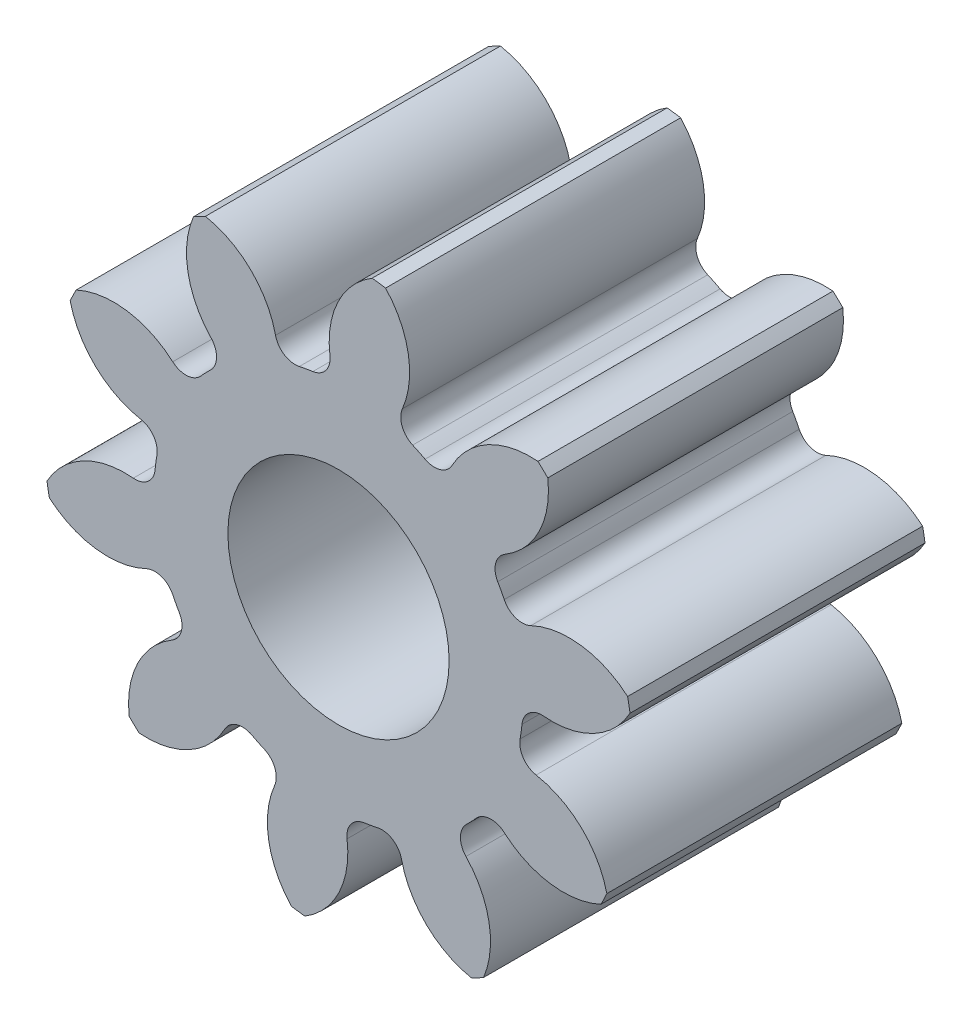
ISO-10303-21;
HEADER;
FILE_DESCRIPTION(('STEP AP214'),'2;1');
FILE_NAME('part.step','',(''),(''),'','','');
FILE_SCHEMA(('AUTOMOTIVE_DESIGN { 1 0 10303 214 1 1 1 1 }'));
ENDSEC;
DATA;
#1=APPLICATION_CONTEXT('core data for automotive mechanical design processes');
#2=APPLICATION_PROTOCOL_DEFINITION('international standard','automotive_design',2000,#1);
#3=PRODUCT_CONTEXT('',#1,'mechanical');
#4=PRODUCT('Part','Part','',(#3));
#5=PRODUCT_RELATED_PRODUCT_CATEGORY('part','',(#4));
#6=PRODUCT_DEFINITION_FORMATION('','',#4);
#7=PRODUCT_DEFINITION_CONTEXT('part definition',#1,'design');
#8=PRODUCT_DEFINITION('design','',#6,#7);
#9=PRODUCT_DEFINITION_SHAPE('','',#8);
#10=(LENGTH_UNIT() NAMED_UNIT(*) SI_UNIT(.MILLI.,.METRE.));
#11=(NAMED_UNIT(*) PLANE_ANGLE_UNIT() SI_UNIT($,.RADIAN.));
#12=(NAMED_UNIT(*) SI_UNIT($,.STERADIAN.) SOLID_ANGLE_UNIT());
#13=UNCERTAINTY_MEASURE_WITH_UNIT(LENGTH_MEASURE(1.E-05),#10,'distance_accuracy_value','');
#14=(GEOMETRIC_REPRESENTATION_CONTEXT(3) GLOBAL_UNCERTAINTY_ASSIGNED_CONTEXT((#13)) GLOBAL_UNIT_ASSIGNED_CONTEXT((#10,
#11,#12)) REPRESENTATION_CONTEXT('',''));
#15=CARTESIAN_POINT('',(0.,0.,0.));
#16=DIRECTION('',(0.,0.,1.));
#17=DIRECTION('',(1.,0.,0.));
#18=AXIS2_PLACEMENT_3D('',#15,#16,#17);
#19=CARTESIAN_POINT('',(0.,0.,101.6));
#20=DIRECTION('',(0.,0.,-1.));
#21=DIRECTION('',(-1.,0.,0.));
#22=AXIS2_PLACEMENT_3D('',#19,#20,#21);
#23=CYLINDRICAL_SURFACE('',#22,101.6);
#24=DIRECTION('',(0.,0.,-1.));
#25=VECTOR('',#24,1.);
#26=CARTESIAN_POINT('',(99.5779491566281,20.169086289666,50.8));
#27=LINE('',#26,#25);
#28=CARTESIAN_POINT('',(99.5779491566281,20.169086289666,101.6));
#29=VERTEX_POINT('',#28);
#30=CARTESIAN_POINT('',(99.5779491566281,20.169086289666,0.));
#31=VERTEX_POINT('',#30);
#32=EDGE_CURVE('E456',#29,#31,#27,.T.);
#33=ORIENTED_EDGE('',*,*,#32,.F.);
#34=CARTESIAN_POINT('',(0.,0.,101.6));
#35=DIRECTION('',(0.,0.,1.));
#36=DIRECTION('',(1.,0.,0.));
#37=AXIS2_PLACEMENT_3D('',#34,#35,#36);
#38=CIRCLE('',#37,101.6);
#39=CARTESIAN_POINT('',(100.400495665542,15.5660036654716,101.6));
#40=VERTEX_POINT('',#39);
#41=EDGE_CURVE('E797',#40,#29,#38,.T.);
#42=ORIENTED_EDGE('',*,*,#41,.F.);
#43=DIRECTION('',(0.,0.,-1.));
#44=VECTOR('',#43,1.);
#45=CARTESIAN_POINT('',(100.400495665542,15.5660036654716,50.8));
#46=LINE('',#45,#44);
#47=CARTESIAN_POINT('',(100.400495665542,15.5660036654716,0.));
#48=VERTEX_POINT('',#47);
#49=EDGE_CURVE('E791',#48,#40,#46,.F.);
#50=ORIENTED_EDGE('',*,*,#49,.F.);
#51=CARTESIAN_POINT('',(0.,0.,0.));
#52=DIRECTION('',(0.,0.,1.));
#53=DIRECTION('',(1.,0.,0.));
#54=AXIS2_PLACEMENT_3D('',#51,#52,#53);
#55=CIRCLE('',#54,101.6);
#56=EDGE_CURVE('E802',#48,#31,#55,.T.);
#57=ORIENTED_EDGE('',*,*,#56,.T.);
#58=EDGE_LOOP('',(#33,#42,#50,#57));
#59=FACE_BOUND('',#58,.T.);
#60=ADVANCED_FACE('F33',(#59),#23,.T.);
#61=DIRECTION('',(0.,0.,-1.));
#62=VECTOR('',#61,1.);
#63=CARTESIAN_POINT('',(72.0762398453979,71.6070921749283,50.8));
#64=LINE('',#63,#62);
#65=CARTESIAN_POINT('',(72.0762398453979,71.6070921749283,0.));
#66=VERTEX_POINT('',#65);
#67=CARTESIAN_POINT('',(72.0762398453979,71.6070921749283,101.6));
#68=VERTEX_POINT('',#67);
#69=EDGE_CURVE('E427',#66,#68,#64,.F.);
#70=ORIENTED_EDGE('',*,*,#69,.F.);
#71=CARTESIAN_POINT('',(68.7051616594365,74.8475835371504,0.));
#72=VERTEX_POINT('',#71);
#73=EDGE_CURVE('E805',#66,#72,#55,.T.);
#74=ORIENTED_EDGE('',*,*,#73,.T.);
#75=DIRECTION('',(0.,0.,-1.));
#76=VECTOR('',#75,1.);
#77=CARTESIAN_POINT('',(68.7051616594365,74.8475835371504,50.8));
#78=LINE('',#77,#76);
#79=CARTESIAN_POINT('',(68.7051616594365,74.8475835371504,101.6));
#80=VERTEX_POINT('',#79);
#81=EDGE_CURVE('E489',#80,#72,#78,.T.);
#82=ORIENTED_EDGE('',*,*,#81,.F.);
#83=EDGE_CURVE('E800',#68,#80,#38,.T.);
#84=ORIENTED_EDGE('',*,*,#83,.F.);
#85=EDGE_LOOP('',(#70,#74,#82,#84));
#86=FACE_BOUND('',#85,.T.);
#87=ADVANCED_FACE('F921',(#86),#23,.T.);
#88=CARTESIAN_POINT('',(0.,0.,101.6));
#89=DIRECTION('',(0.,0.,1.));
#90=DIRECTION('',(1.,0.,0.));
#91=AXIS2_PLACEMENT_3D('',#88,#89,#90);
#92=PLANE('',#91);
#93=CARTESIAN_POINT('',(0.,0.,101.599999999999));
#94=DIRECTION('',(0.,0.,1.));
#95=DIRECTION('',(1.,0.,0.));
#96=AXIS2_PLACEMENT_3D('',#93,#94,#95);
#97=CIRCLE('',#96,38.1);
#98=CARTESIAN_POINT('',(38.1,0.,101.599999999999));
#99=VERTEX_POINT('',#98);
#100=EDGE_CURVE('E444',#99,#99,#97,.T.);
#101=ORIENTED_EDGE('',*,*,#100,.F.);
#102=EDGE_LOOP('',(#101));
#103=FACE_BOUND('',#102,.T.);
#104=ORIENTED_EDGE('',*,*,#41,.T.);
#105=CARTESIAN_POINT('',(79.5000119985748,-3.10545176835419,101.6));
#106=DIRECTION('',(0.,0.,-1.));
#107=DIRECTION('',(0.809016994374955,0.587785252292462,0.));
#108=AXIS2_PLACEMENT_3D('',#105,#106,#107);
#109=CIRCLE('',#108,30.7380494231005);
#110=CARTESIAN_POINT('',(66.2453340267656,24.6279431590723,101.6));
#111=VERTEX_POINT('',#110);
#112=EDGE_CURVE('E436',#111,#29,#109,.T.);
#113=ORIENTED_EDGE('',*,*,#112,.F.);
#114=CARTESIAN_POINT('',(63.2734644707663,30.8461275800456,101.6));
#115=DIRECTION('',(0.,0.,1.));
#116=DIRECTION('',(-0.809016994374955,-0.587785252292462,0.));
#117=AXIS2_PLACEMENT_3D('',#114,#115,#116);
#118=CIRCLE('',#117,6.89186666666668);
#119=CARTESIAN_POINT('',(57.0785402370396,27.8260713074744,101.6));
#120=VERTEX_POINT('',#119);
#121=EDGE_CURVE('E434',#120,#111,#118,.T.);
#122=ORIENTED_EDGE('',*,*,#121,.F.);
#123=CARTESIAN_POINT('',(0.,0.,101.6));
#124=DIRECTION('',(0.,0.,-1.));
#125=DIRECTION('',(0.809016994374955,0.587785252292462,0.));
#126=AXIS2_PLACEMENT_3D('',#123,#124,#125);
#127=CIRCLE('',#126,63.5);
#128=CARTESIAN_POINT('',(54.8403900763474,32.0122104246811,101.6));
#129=VERTEX_POINT('',#128);
#130=EDGE_CURVE('E419',#129,#120,#127,.T.);
#131=ORIENTED_EDGE('',*,*,#130,.F.);
#132=CARTESIAN_POINT('',(60.7924004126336,35.4866023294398,101.6));
#133=DIRECTION('',(0.,0.,1.));
#134=DIRECTION('',(-0.809016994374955,-0.587785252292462,0.));
#135=AXIS2_PLACEMENT_3D('',#132,#133,#134);
#136=CIRCLE('',#135,6.89186666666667);
#137=CARTESIAN_POINT('',(57.2719034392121,41.4114590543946,101.6));
#138=VERTEX_POINT('',#137);
#139=EDGE_CURVE('E411',#138,#129,#136,.T.);
#140=ORIENTED_EDGE('',*,*,#139,.F.);
#141=CARTESIAN_POINT('',(41.5703213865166,67.8365986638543,101.6));
#142=DIRECTION('',(0.,0.,-1.));
#143=DIRECTION('',(-0.809016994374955,-0.587785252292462,0.));
#144=AXIS2_PLACEMENT_3D('',#141,#142,#143);
#145=CIRCLE('',#144,30.7380494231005);
#146=EDGE_CURVE('E441',#68,#138,#145,.T.);
#147=ORIENTED_EDGE('',*,*,#146,.F.);
#148=ORIENTED_EDGE('',*,*,#83,.T.);
#149=CARTESIAN_POINT('',(66.1421995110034,44.2165713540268,101.6));
#150=DIRECTION('',(0.,0.,-1.));
#151=DIRECTION('',(0.309016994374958,0.95105651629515,0.));
#152=AXIS2_PLACEMENT_3D('',#149,#150,#151);
#153=CIRCLE('',#152,30.7380494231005);
#154=CARTESIAN_POINT('',(39.1176592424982,58.8624549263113,101.6));
#155=VERTEX_POINT('',#154);
#156=EDGE_CURVE('E465',#155,#80,#153,.T.);
#157=ORIENTED_EDGE('',*,*,#156,.F.);
#158=CARTESIAN_POINT('',(33.0584091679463,62.146250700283,101.6));
#159=DIRECTION('',(0.,0.,1.));
#160=DIRECTION('',(-0.309016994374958,-0.95105651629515,0.));
#161=AXIS2_PLACEMENT_3D('',#158,#159,#160);
#162=CIRCLE('',#161,6.89186666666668);
#163=CARTESIAN_POINT('',(29.821754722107,56.0616887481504,101.6));
#164=VERTEX_POINT('',#163);
#165=EDGE_CURVE('E463',#164,#155,#162,.T.);
#166=ORIENTED_EDGE('',*,*,#165,.F.);
#167=CARTESIAN_POINT('',(0.,0.,101.6));
#168=DIRECTION('',(0.,0.,-1.));
#169=DIRECTION('',(0.309016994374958,0.95105651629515,0.));
#170=AXIS2_PLACEMENT_3D('',#167,#168,#169);
#171=CIRCLE('',#170,63.5);
#172=CARTESIAN_POINT('',(25.5505023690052,58.1327947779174,101.6));
#173=VERTEX_POINT('',#172);
#174=EDGE_CURVE('E460',#173,#164,#171,.T.);
#175=ORIENTED_EDGE('',*,*,#174,.F.);
#176=CARTESIAN_POINT('',(28.3235835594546,64.4421407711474,101.6));
#177=DIRECTION('',(0.,0.,1.));
#178=DIRECTION('',(-0.309016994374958,-0.95105651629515,0.));
#179=AXIS2_PLACEMENT_3D('',#176,#177,#178);
#180=CIRCLE('',#179,6.89186666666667);
#181=CARTESIAN_POINT('',(21.9928982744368,67.166154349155,101.6));
#182=VERTEX_POINT('',#181);
#183=EDGE_CURVE('E458',#182,#173,#180,.T.);
#184=ORIENTED_EDGE('',*,*,#183,.F.);
#185=CARTESIAN_POINT('',(-6.24225579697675,79.3153830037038,101.6));
#186=DIRECTION('',(0.,0.,-1.));
#187=DIRECTION('',(-0.309016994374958,-0.95105651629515,0.));
#188=AXIS2_PLACEMENT_3D('',#185,#186,#187);
#189=CIRCLE('',#188,30.7380494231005);
#190=CARTESIAN_POINT('',(16.2213101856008,100.29670530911,101.6));
#191=VERTEX_POINT('',#190);
#192=EDGE_CURVE('E468',#191,#182,#189,.T.);
#193=ORIENTED_EDGE('',*,*,#192,.F.);
#194=CARTESIAN_POINT('',(11.5893376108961,100.93684784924,101.6));
#195=VERTEX_POINT('',#194);
#196=EDGE_CURVE('E833',#191,#195,#38,.T.);
#197=ORIENTED_EDGE('',*,*,#196,.T.);
#198=CARTESIAN_POINT('',(27.5203149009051,74.6493670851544,101.6));
#199=DIRECTION('',(0.,0.,-1.));
#200=DIRECTION('',(-0.309016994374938,0.951056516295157,0.));
#201=AXIS2_PLACEMENT_3D('',#198,#199,#200);
#202=CIRCLE('',#201,30.7380494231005);
#203=CARTESIAN_POINT('',(-2.95163181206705,70.613509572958,101.6));
#204=VERTEX_POINT('',#203);
#205=EDGE_CURVE('E500',#204,#195,#202,.T.);
#206=ORIENTED_EDGE('',*,*,#205,.F.);
#207=CARTESIAN_POINT('',(-9.78383482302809,69.708618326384,101.6));
#208=DIRECTION('',(0.,0.,1.));
#209=DIRECTION('',(0.309016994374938,-0.951056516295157,0.));
#210=AXIS2_PLACEMENT_3D('',#207,#208,#209);
#211=CIRCLE('',#210,6.89186666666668);
#212=CARTESIAN_POINT('',(-8.82592749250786,62.8836465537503,101.6));
#213=VERTEX_POINT('',#212);
#214=EDGE_CURVE('E498',#213,#204,#211,.T.);
#215=ORIENTED_EDGE('',*,*,#214,.F.);
#216=CARTESIAN_POINT('',(0.,0.,101.6));
#217=DIRECTION('',(0.,0.,-1.));
#218=DIRECTION('',(-0.309016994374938,0.951056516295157,0.));
#219=AXIS2_PLACEMENT_3D('',#216,#217,#218);
#220=CIRCLE('',#219,63.5);
#221=CARTESIAN_POINT('',(-13.4988088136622,62.0486273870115,101.6));
#222=VERTEX_POINT('',#221);
#223=EDGE_CURVE('E495',#222,#213,#220,.T.);
#224=ORIENTED_EDGE('',*,*,#223,.F.);
#225=CARTESIAN_POINT('',(-14.9638795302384,68.7829717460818,101.6));
#226=DIRECTION('',(0.,0.,1.));
#227=DIRECTION('',(0.309016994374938,-0.951056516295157,0.));
#228=AXIS2_PLACEMENT_3D('',#225,#226,#227);
#229=CIRCLE('',#228,6.89186666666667);
#230=CARTESIAN_POINT('',(-21.6866465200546,67.2656615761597,101.6));
#231=VERTEX_POINT('',#230);
#232=EDGE_CURVE('E493',#231,#222,#229,.T.);
#233=ORIENTED_EDGE('',*,*,#232,.F.);
#234=CARTESIAN_POINT('',(-51.670503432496,60.498386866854,101.6));
#235=DIRECTION('',(0.,0.,-1.));
#236=DIRECTION('',(0.309016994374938,-0.951056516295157,0.));
#237=AXIS2_PLACEMENT_3D('',#234,#235,#236);
#238=CIRCLE('',#237,30.7380494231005);
#239=CARTESIAN_POINT('',(-45.829608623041,90.6763859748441,101.6));
#240=VERTEX_POINT('',#239);
#241=EDGE_CURVE('E503',#240,#231,#238,.T.);
#242=ORIENTED_EDGE('',*,*,#241,.F.);
#243=CARTESIAN_POINT('',(-49.953219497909,88.4716670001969,101.6));
#244=VERTEX_POINT('',#243);
#245=EDGE_CURVE('E903',#240,#244,#38,.T.);
#246=ORIENTED_EDGE('',*,*,#245,.T.);
#247=CARTESIAN_POINT('',(-21.6133946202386,76.5686418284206,101.6));
#248=DIRECTION('',(0.,0.,-1.));
#249=DIRECTION('',(-0.809016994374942,0.58778525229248,0.));
#250=AXIS2_PLACEMENT_3D('',#247,#248,#249);
#251=CIRCLE('',#250,30.7380494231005);
#252=CARTESIAN_POINT('',(-43.8934998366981,55.3926036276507,101.6));
#253=VERTEX_POINT('',#252);
#254=EDGE_CURVE('E538',#253,#244,#251,.T.);
#255=ORIENTED_EDGE('',*,*,#254,.F.);
#256=CARTESIAN_POINT('',(-48.8889864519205,50.6446630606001,101.6));
#257=DIRECTION('',(0.,0.,1.));
#258=DIRECTION('',(0.809016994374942,-0.58778525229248,0.));
#259=AXIS2_PLACEMENT_3D('',#256,#257,#258);
#260=CIRCLE('',#259,6.89186666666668);
#261=CARTESIAN_POINT('',(-44.1024053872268,45.6861887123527,101.6));
#262=VERTEX_POINT('',#261);
#263=EDGE_CURVE('E536',#262,#253,#260,.T.);
#264=ORIENTED_EDGE('',*,*,#263,.F.);
#265=CARTESIAN_POINT('',(0.,0.,101.6));
#266=DIRECTION('',(0.,0.,-1.));
#267=DIRECTION('',(-0.809016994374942,0.58778525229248,0.));
#268=AXIS2_PLACEMENT_3D('',#265,#266,#267);
#269=CIRCLE('',#268,63.5);
#270=CARTESIAN_POINT('',(-47.3920338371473,42.2639932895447,101.6));
#271=VERTEX_POINT('',#270);
#272=EDGE_CURVE('E533',#271,#262,#269,.T.);
#273=ORIENTED_EDGE('',*,*,#272,.F.);
#274=CARTESIAN_POINT('',(-52.5356492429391,46.8510453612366,101.6));
#275=DIRECTION('',(0.,0.,1.));
#276=DIRECTION('',(0.809016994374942,-0.58778525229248,0.));
#277=AXIS2_PLACEMENT_3D('',#274,#275,#276);
#278=CIRCLE('',#277,6.89186666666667);
#279=CARTESIAN_POINT('',(-57.0826294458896,41.6719723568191,101.6));
#280=VERTEX_POINT('',#279);
#281=EDGE_CURVE('E531',#280,#271,#278,.T.);
#282=ORIENTED_EDGE('',*,*,#281,.F.);
#283=CARTESIAN_POINT('',(-77.3623749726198,18.5730632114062,101.6));
#284=DIRECTION('',(0.,0.,-1.));
#285=DIRECTION('',(0.809016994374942,-0.58778525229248,0.));
#286=AXIS2_PLACEMENT_3D('',#283,#284,#285);
#287=CIRCLE('',#286,30.7380494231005);
#288=CARTESIAN_POINT('',(-90.3751746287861,46.4207691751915,101.6));
#289=VERTEX_POINT('',#288);
#290=EDGE_CURVE('E541',#289,#280,#287,.T.);
#291=ORIENTED_EDGE('',*,*,#290,.F.);
#292=CARTESIAN_POINT('',(-92.4153446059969,42.2133163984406,101.6));
#293=VERTEX_POINT('',#292);
#294=EDGE_CURVE('E899',#289,#293,#38,.T.);
#295=ORIENTED_EDGE('',*,*,#294,.T.);
#296=CARTESIAN_POINT('',(-62.4915220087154,49.2412978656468,101.6));
#297=DIRECTION('',(0.,0.,-1.));
#298=DIRECTION('',(-1.,0.,0.));
#299=AXIS2_PLACEMENT_3D('',#296,#297,#298);
#300=CIRCLE('',#299,30.7380494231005);
#301=CARTESIAN_POINT('',(-68.0695428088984,19.0136058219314,101.6));
#302=VERTEX_POINT('',#301);
#303=EDGE_CURVE('E576',#302,#293,#300,.T.);
#304=ORIENTED_EDGE('',*,*,#303,.F.);
#305=CARTESIAN_POINT('',(-69.3202069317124,12.2361678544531,101.6));
#306=DIRECTION('',(0.,0.,1.));
#307=DIRECTION('',(1.,0.,0.));
#308=AXIS2_PLACEMENT_3D('',#305,#306,#307);
#309=CIRCLE('',#308,6.89186666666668);
#310=CARTESIAN_POINT('',(-62.5332634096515,11.0381595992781,101.6));
#311=VERTEX_POINT('',#310);
#312=EDGE_CURVE('E574',#311,#302,#309,.T.);
#313=ORIENTED_EDGE('',*,*,#312,.F.);
#314=CARTESIAN_POINT('',(0.,0.,101.6));
#315=DIRECTION('',(0.,0.,-1.));
#316=DIRECTION('',(-1.,0.,0.));
#317=AXIS2_PLACEMENT_3D('',#314,#315,#316);
#318=CIRCLE('',#317,63.5);
#319=CARTESIAN_POINT('',(-63.1831127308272,6.33595025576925,101.6));
#320=VERTEX_POINT('',#319);
#321=EDGE_CURVE('E571',#320,#311,#318,.T.);
#322=ORIENTED_EDGE('',*,*,#321,.F.);
#323=CARTESIAN_POINT('',(-70.0405865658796,7.02361205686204,101.6));
#324=DIRECTION('',(0.,0.,1.));
#325=DIRECTION('',(1.,0.,0.));
#326=AXIS2_PLACEMENT_3D('',#323,#324,#325);
#327=CIRCLE('',#326,6.89186666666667);
#328=CARTESIAN_POINT('',(-70.6749880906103,0.161006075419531,101.6));
#329=VERTEX_POINT('',#328);
#330=EDGE_CURVE('E569',#329,#320,#327,.T.);
#331=ORIENTED_EDGE('',*,*,#330,.F.);
#332=CARTESIAN_POINT('',(-73.5044487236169,-30.4465393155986,101.6));
#333=DIRECTION('',(0.,0.,-1.));
#334=DIRECTION('',(1.,0.,0.));
#335=AXIS2_PLACEMENT_3D('',#332,#333,#334);
#336=CIRCLE('',#335,30.7380494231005);
#337=CARTESIAN_POINT('',(-100.400495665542,-15.566003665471,101.6));
#338=VERTEX_POINT('',#337);
#339=EDGE_CURVE('E579',#338,#329,#336,.T.);
#340=ORIENTED_EDGE('',*,*,#339,.F.);
#341=CARTESIAN_POINT('',(-99.5779491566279,-20.1690862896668,101.6));
#342=VERTEX_POINT('',#341);
#343=EDGE_CURVE('E895',#338,#342,#38,.T.);
#344=ORIENTED_EDGE('',*,*,#343,.T.);
#345=CARTESIAN_POINT('',(-79.5000119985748,3.1054517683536,101.6));
#346=DIRECTION('',(0.,0.,-1.));
#347=DIRECTION('',(-0.809016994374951,-0.587785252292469,0.));
#348=AXIS2_PLACEMENT_3D('',#345,#346,#347);
#349=CIRCLE('',#348,30.7380494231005);
#350=CARTESIAN_POINT('',(-66.2453340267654,-24.6279431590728,101.6));
#351=VERTEX_POINT('',#350);
#352=EDGE_CURVE('E614',#351,#342,#349,.T.);
#353=ORIENTED_EDGE('',*,*,#352,.F.);
#354=CARTESIAN_POINT('',(-63.2734644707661,-30.8461275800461,101.6));
#355=DIRECTION('',(0.,0.,1.));
#356=DIRECTION('',(0.809016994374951,0.587785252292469,0.));
#357=AXIS2_PLACEMENT_3D('',#354,#355,#356);
#358=CIRCLE('',#357,6.89186666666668);
#359=CARTESIAN_POINT('',(-57.0785402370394,-27.8260713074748,101.6));
#360=VERTEX_POINT('',#359);
#361=EDGE_CURVE('E612',#360,#351,#358,.T.);
#362=ORIENTED_EDGE('',*,*,#361,.F.);
#363=CARTESIAN_POINT('',(0.,0.,101.6));
#364=DIRECTION('',(0.,0.,-1.));
#365=DIRECTION('',(-0.809016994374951,-0.587785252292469,0.));
#366=AXIS2_PLACEMENT_3D('',#363,#364,#365);
#367=CIRCLE('',#366,63.5);
#368=CARTESIAN_POINT('',(-54.8403900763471,-32.0122104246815,101.6));
#369=VERTEX_POINT('',#368);
#370=EDGE_CURVE('E609',#369,#360,#367,.T.);
#371=ORIENTED_EDGE('',*,*,#370,.F.);
#372=CARTESIAN_POINT('',(-60.7924004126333,-35.4866023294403,101.6));
#373=DIRECTION('',(0.,0.,1.));
#374=DIRECTION('',(0.809016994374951,0.587785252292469,0.));
#375=AXIS2_PLACEMENT_3D('',#372,#373,#374);
#376=CIRCLE('',#375,6.89186666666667);
#377=CARTESIAN_POINT('',(-57.2719034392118,-41.411459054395,101.6));
#378=VERTEX_POINT('',#377);
#379=EDGE_CURVE('E607',#378,#369,#376,.T.);
#380=ORIENTED_EDGE('',*,*,#379,.F.);
#381=CARTESIAN_POINT('',(-41.5703213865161,-67.8365986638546,101.6));
#382=DIRECTION('',(0.,0.,-1.));
#383=DIRECTION('',(0.809016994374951,0.587785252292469,0.));
#384=AXIS2_PLACEMENT_3D('',#381,#382,#383);
#385=CIRCLE('',#384,30.7380494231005);
#386=CARTESIAN_POINT('',(-72.0762398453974,-71.6070921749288,101.6));
#387=VERTEX_POINT('',#386);
#388=EDGE_CURVE('E617',#387,#378,#385,.T.);
#389=ORIENTED_EDGE('',*,*,#388,.F.);
#390=CARTESIAN_POINT('',(-68.7051616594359,-74.8475835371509,101.6));
#391=VERTEX_POINT('',#390);
#392=EDGE_CURVE('E891',#387,#391,#38,.T.);
#393=ORIENTED_EDGE('',*,*,#392,.T.);
#394=CARTESIAN_POINT('',(-66.1421995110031,-44.2165713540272,101.6));
#395=DIRECTION('',(0.,0.,-1.));
#396=DIRECTION('',(-0.309016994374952,-0.951056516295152,0.));
#397=AXIS2_PLACEMENT_3D('',#394,#395,#396);
#398=CIRCLE('',#397,30.7380494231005);
#399=CARTESIAN_POINT('',(-39.1176592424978,-58.8624549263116,101.6));
#400=VERTEX_POINT('',#399);
#401=EDGE_CURVE('E652',#400,#391,#398,.T.);
#402=ORIENTED_EDGE('',*,*,#401,.F.);
#403=CARTESIAN_POINT('',(-33.0584091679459,-62.1462507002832,101.6));
#404=DIRECTION('',(0.,0.,1.));
#405=DIRECTION('',(0.309016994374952,0.951056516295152,0.));
#406=AXIS2_PLACEMENT_3D('',#403,#404,#405);
#407=CIRCLE('',#406,6.89186666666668);
#408=CARTESIAN_POINT('',(-29.8217547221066,-56.0616887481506,101.6));
#409=VERTEX_POINT('',#408);
#410=EDGE_CURVE('E650',#409,#400,#407,.T.);
#411=ORIENTED_EDGE('',*,*,#410,.F.);
#412=CARTESIAN_POINT('',(0.,0.,101.6));
#413=DIRECTION('',(0.,0.,-1.));
#414=DIRECTION('',(-0.309016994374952,-0.951056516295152,0.));
#415=AXIS2_PLACEMENT_3D('',#412,#413,#414);
#416=CIRCLE('',#415,63.5);
#417=CARTESIAN_POINT('',(-25.5505023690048,-58.1327947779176,101.6));
#418=VERTEX_POINT('',#417);
#419=EDGE_CURVE('E647',#418,#409,#416,.T.);
#420=ORIENTED_EDGE('',*,*,#419,.F.);
#421=CARTESIAN_POINT('',(-28.3235835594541,-64.4421407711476,101.6));
#422=DIRECTION('',(0.,0.,1.));
#423=DIRECTION('',(0.309016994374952,0.951056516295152,0.));
#424=AXIS2_PLACEMENT_3D('',#421,#422,#423);
#425=CIRCLE('',#424,6.89186666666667);
#426=CARTESIAN_POINT('',(-21.9928982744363,-67.1661543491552,101.6));
#427=VERTEX_POINT('',#426);
#428=EDGE_CURVE('E645',#427,#418,#425,.T.);
#429=ORIENTED_EDGE('',*,*,#428,.F.);
#430=CARTESIAN_POINT('',(6.24225579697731,-79.3153830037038,101.6));
#431=DIRECTION('',(0.,0.,-1.));
#432=DIRECTION('',(0.309016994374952,0.951056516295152,0.));
#433=AXIS2_PLACEMENT_3D('',#430,#431,#432);
#434=CIRCLE('',#433,30.7380494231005);
#435=CARTESIAN_POINT('',(-16.2213101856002,-100.29670530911,101.6));
#436=VERTEX_POINT('',#435);
#437=EDGE_CURVE('E655',#436,#427,#434,.T.);
#438=ORIENTED_EDGE('',*,*,#437,.F.);
#439=CARTESIAN_POINT('',(-11.5893376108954,-100.93684784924,101.6));
#440=VERTEX_POINT('',#439);
#441=EDGE_CURVE('E887',#436,#440,#38,.T.);
#442=ORIENTED_EDGE('',*,*,#441,.T.);
#443=CARTESIAN_POINT('',(-27.5203149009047,-74.6493670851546,101.6));
#444=DIRECTION('',(0.,0.,-1.));
#445=DIRECTION('',(0.309016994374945,-0.951056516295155,0.));
#446=AXIS2_PLACEMENT_3D('',#443,#444,#445);
#447=CIRCLE('',#446,30.7380494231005);
#448=CARTESIAN_POINT('',(2.95163181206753,-70.613509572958,101.6));
#449=VERTEX_POINT('',#448);
#450=EDGE_CURVE('E690',#449,#440,#447,.T.);
#451=ORIENTED_EDGE('',*,*,#450,.F.);
#452=CARTESIAN_POINT('',(9.78383482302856,-69.708618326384,101.6));
#453=DIRECTION('',(0.,0.,1.));
#454=DIRECTION('',(-0.309016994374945,0.951056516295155,0.));
#455=AXIS2_PLACEMENT_3D('',#452,#453,#454);
#456=CIRCLE('',#455,6.89186666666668);
#457=CARTESIAN_POINT('',(8.82592749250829,-62.8836465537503,101.6));
#458=VERTEX_POINT('',#457);
#459=EDGE_CURVE('E688',#458,#449,#456,.T.);
#460=ORIENTED_EDGE('',*,*,#459,.F.);
#461=CARTESIAN_POINT('',(0.,0.,101.6));
#462=DIRECTION('',(0.,0.,-1.));
#463=DIRECTION('',(0.309016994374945,-0.951056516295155,0.));
#464=AXIS2_PLACEMENT_3D('',#461,#462,#463);
#465=CIRCLE('',#464,63.5);
#466=CARTESIAN_POINT('',(13.4988088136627,-62.0486273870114,101.6));
#467=VERTEX_POINT('',#466);
#468=EDGE_CURVE('E685',#467,#458,#465,.T.);
#469=ORIENTED_EDGE('',*,*,#468,.F.);
#470=CARTESIAN_POINT('',(14.9638795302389,-68.7829717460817,101.6));
#471=DIRECTION('',(0.,0.,1.));
#472=DIRECTION('',(-0.309016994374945,0.951056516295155,0.));
#473=AXIS2_PLACEMENT_3D('',#470,#471,#472);
#474=CIRCLE('',#473,6.89186666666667);
#475=CARTESIAN_POINT('',(21.686646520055,-67.2656615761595,101.6));
#476=VERTEX_POINT('',#475);
#477=EDGE_CURVE('E683',#476,#467,#474,.T.);
#478=ORIENTED_EDGE('',*,*,#477,.F.);
#479=CARTESIAN_POINT('',(51.6705034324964,-60.4983868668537,101.6));
#480=DIRECTION('',(0.,0.,-1.));
#481=DIRECTION('',(-0.309016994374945,0.951056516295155,0.));
#482=AXIS2_PLACEMENT_3D('',#479,#480,#481);
#483=CIRCLE('',#482,30.7380494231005);
#484=CARTESIAN_POINT('',(45.8296086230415,-90.6763859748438,101.6));
#485=VERTEX_POINT('',#484);
#486=EDGE_CURVE('E693',#485,#476,#483,.T.);
#487=ORIENTED_EDGE('',*,*,#486,.F.);
#488=CARTESIAN_POINT('',(49.9532194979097,-88.4716670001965,101.6));
#489=VERTEX_POINT('',#488);
#490=EDGE_CURVE('E886',#485,#489,#38,.T.);
#491=ORIENTED_EDGE('',*,*,#490,.T.);
#492=CARTESIAN_POINT('',(21.6133946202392,-76.5686418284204,101.6));
#493=DIRECTION('',(0.,0.,-1.));
#494=DIRECTION('',(0.809016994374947,-0.587785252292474,0.));
#495=AXIS2_PLACEMENT_3D('',#492,#493,#494);
#496=CIRCLE('',#495,30.7380494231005);
#497=CARTESIAN_POINT('',(43.8934998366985,-55.3926036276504,101.6));
#498=VERTEX_POINT('',#497);
#499=EDGE_CURVE('E728',#498,#489,#496,.T.);
#500=ORIENTED_EDGE('',*,*,#499,.F.);
#501=CARTESIAN_POINT('',(48.8889864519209,-50.6446630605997,101.6));
#502=DIRECTION('',(0.,0.,1.));
#503=DIRECTION('',(-0.809016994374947,0.587785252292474,0.));
#504=AXIS2_PLACEMENT_3D('',#501,#502,#503);
#505=CIRCLE('',#504,6.89186666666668);
#506=CARTESIAN_POINT('',(44.1024053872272,-45.6861887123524,101.6));
#507=VERTEX_POINT('',#506);
#508=EDGE_CURVE('E726',#507,#498,#505,.T.);
#509=ORIENTED_EDGE('',*,*,#508,.F.);
#510=CARTESIAN_POINT('',(0.,0.,101.6));
#511=DIRECTION('',(0.,0.,-1.));
#512=DIRECTION('',(0.809016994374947,-0.587785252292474,0.));
#513=AXIS2_PLACEMENT_3D('',#510,#511,#512);
#514=CIRCLE('',#513,63.5);
#515=CARTESIAN_POINT('',(47.3920338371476,-42.2639932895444,101.6));
#516=VERTEX_POINT('',#515);
#517=EDGE_CURVE('E723',#516,#507,#514,.T.);
#518=ORIENTED_EDGE('',*,*,#517,.F.);
#519=CARTESIAN_POINT('',(52.5356492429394,-46.8510453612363,101.6));
#520=DIRECTION('',(0.,0.,1.));
#521=DIRECTION('',(-0.809016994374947,0.587785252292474,0.));
#522=AXIS2_PLACEMENT_3D('',#519,#520,#521);
#523=CIRCLE('',#522,6.89186666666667);
#524=CARTESIAN_POINT('',(57.0826294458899,-41.6719723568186,101.6));
#525=VERTEX_POINT('',#524);
#526=EDGE_CURVE('E721',#525,#516,#523,.T.);
#527=ORIENTED_EDGE('',*,*,#526,.F.);
#528=CARTESIAN_POINT('',(77.3623749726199,-18.5730632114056,101.6));
#529=DIRECTION('',(0.,0.,-1.));
#530=DIRECTION('',(-0.809016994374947,0.587785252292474,0.));
#531=AXIS2_PLACEMENT_3D('',#528,#529,#530);
#532=CIRCLE('',#531,30.7380494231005);
#533=CARTESIAN_POINT('',(90.3751746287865,-46.4207691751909,101.6));
#534=VERTEX_POINT('',#533);
#535=EDGE_CURVE('E731',#534,#525,#532,.T.);
#536=ORIENTED_EDGE('',*,*,#535,.F.);
#537=CARTESIAN_POINT('',(92.4153446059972,-42.21331639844,101.6));
#538=VERTEX_POINT('',#537);
#539=EDGE_CURVE('E801',#534,#538,#38,.T.);
#540=ORIENTED_EDGE('',*,*,#539,.T.);
#541=CARTESIAN_POINT('',(62.4915220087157,-49.2412978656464,101.6));
#542=DIRECTION('',(0.,0.,-1.));
#543=DIRECTION('',(1.,0.,0.));
#544=AXIS2_PLACEMENT_3D('',#541,#542,#543);
#545=CIRCLE('',#544,30.7380494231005);
#546=CARTESIAN_POINT('',(68.0695428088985,-19.013605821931,101.6));
#547=VERTEX_POINT('',#546);
#548=EDGE_CURVE('E766',#547,#538,#545,.T.);
#549=ORIENTED_EDGE('',*,*,#548,.F.);
#550=CARTESIAN_POINT('',(69.3202069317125,-12.2361678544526,101.6));
#551=DIRECTION('',(0.,0.,1.));
#552=DIRECTION('',(-1.,0.,0.));
#553=AXIS2_PLACEMENT_3D('',#550,#551,#552);
#554=CIRCLE('',#553,6.89186666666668);
#555=CARTESIAN_POINT('',(62.5332634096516,-11.0381595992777,101.6));
#556=VERTEX_POINT('',#555);
#557=EDGE_CURVE('E764',#556,#547,#554,.T.);
#558=ORIENTED_EDGE('',*,*,#557,.F.);
#559=CARTESIAN_POINT('',(0.,0.,101.6));
#560=DIRECTION('',(0.,0.,-1.));
#561=DIRECTION('',(1.,0.,0.));
#562=AXIS2_PLACEMENT_3D('',#559,#560,#561);
#563=CIRCLE('',#562,63.5);
#564=CARTESIAN_POINT('',(63.1831127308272,-6.33595025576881,101.6));
#565=VERTEX_POINT('',#564);
#566=EDGE_CURVE('E761',#565,#556,#563,.T.);
#567=ORIENTED_EDGE('',*,*,#566,.F.);
#568=CARTESIAN_POINT('',(70.0405865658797,-7.02361205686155,101.6));
#569=DIRECTION('',(0.,0.,1.));
#570=DIRECTION('',(-1.,0.,0.));
#571=AXIS2_PLACEMENT_3D('',#568,#569,#570);
#572=CIRCLE('',#571,6.89186666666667);
#573=CARTESIAN_POINT('',(70.6749880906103,-0.161006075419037,101.6));
#574=VERTEX_POINT('',#573);
#575=EDGE_CURVE('E759',#574,#565,#572,.T.);
#576=ORIENTED_EDGE('',*,*,#575,.F.);
#577=CARTESIAN_POINT('',(73.5044487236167,30.4465393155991,101.6));
#578=DIRECTION('',(0.,0.,-1.));
#579=DIRECTION('',(-1.,0.,0.));
#580=AXIS2_PLACEMENT_3D('',#577,#578,#579);
#581=CIRCLE('',#580,30.7380494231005);
#582=EDGE_CURVE('E769',#40,#574,#581,.T.);
#583=ORIENTED_EDGE('',*,*,#582,.F.);
#584=EDGE_LOOP('',(#104,#113,#122,#131,#140,#147,#148,#157,#166,#175,#184,#193,#197,#206,#215,
#224,#233,#242,#246,#255,#264,#273,#282,#291,#295,#304,#313,#322,#331,#340,#344,#353,#362,#371,
#380,#389,#393,#402,#411,#420,#429,#438,#442,#451,#460,#469,#478,#487,#491,#500,#509,#518,#527,
#536,#540,#549,#558,#567,#576,#583));
#585=FACE_BOUND('',#584,.T.);
#586=ADVANCED_FACE('F432',(#103,#585),#92,.T.);
#587=CARTESIAN_POINT('',(0.,0.,0.));
#588=DIRECTION('',(0.,0.,1.));
#589=DIRECTION('',(1.,0.,0.));
#590=AXIS2_PLACEMENT_3D('',#587,#588,#589);
#591=PLANE('',#590);
#592=CARTESIAN_POINT('',(0.,0.,0.));
#593=DIRECTION('',(0.,0.,1.));
#594=DIRECTION('',(1.,0.,0.));
#595=AXIS2_PLACEMENT_3D('',#592,#593,#594);
#596=CIRCLE('',#595,38.1);
#597=CARTESIAN_POINT('',(38.1,0.,-1.77635683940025E-12));
#598=VERTEX_POINT('',#597);
#599=EDGE_CURVE('E36',#598,#598,#596,.T.);
#600=ORIENTED_EDGE('',*,*,#599,.T.);
#601=EDGE_LOOP('',(#600));
#602=FACE_BOUND('',#601,.T.);
#603=CARTESIAN_POINT('',(79.5000119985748,-3.10545176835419,0.));
#604=DIRECTION('',(0.,0.,-1.));
#605=DIRECTION('',(0.809016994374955,0.587785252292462,0.));
#606=AXIS2_PLACEMENT_3D('',#603,#604,#605);
#607=CIRCLE('',#606,30.7380494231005);
#608=CARTESIAN_POINT('',(66.2453340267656,24.6279431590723,0.));
#609=VERTEX_POINT('',#608);
#610=EDGE_CURVE('E420',#609,#31,#607,.T.);
#611=ORIENTED_EDGE('',*,*,#610,.T.);
#612=ORIENTED_EDGE('',*,*,#56,.F.);
#613=CARTESIAN_POINT('',(73.5044487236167,30.4465393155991,0.));
#614=DIRECTION('',(0.,0.,1.));
#615=DIRECTION('',(1.,0.,0.));
#616=AXIS2_PLACEMENT_3D('',#613,#614,#615);
#617=CIRCLE('',#616,30.7380494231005);
#618=CARTESIAN_POINT('',(70.6749880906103,-0.161006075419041,0.));
#619=VERTEX_POINT('',#618);
#620=EDGE_CURVE('E799',#619,#48,#617,.T.);
#621=ORIENTED_EDGE('',*,*,#620,.F.);
#622=CARTESIAN_POINT('',(70.0405865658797,-7.02361205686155,0.));
#623=DIRECTION('',(0.,0.,1.));
#624=DIRECTION('',(-1.,0.,0.));
#625=AXIS2_PLACEMENT_3D('',#622,#623,#624);
#626=CIRCLE('',#625,6.89186666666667);
#627=CARTESIAN_POINT('',(63.1831127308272,-6.33595025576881,0.));
#628=VERTEX_POINT('',#627);
#629=EDGE_CURVE('E758',#619,#628,#626,.T.);
#630=ORIENTED_EDGE('',*,*,#629,.T.);
#631=CARTESIAN_POINT('',(0.,0.,0.));
#632=DIRECTION('',(0.,0.,-1.));
#633=DIRECTION('',(1.,0.,0.));
#634=AXIS2_PLACEMENT_3D('',#631,#632,#633);
#635=CIRCLE('',#634,63.5);
#636=CARTESIAN_POINT('',(62.5332634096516,-11.0381595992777,0.));
#637=VERTEX_POINT('',#636);
#638=EDGE_CURVE('E774',#628,#637,#635,.T.);
#639=ORIENTED_EDGE('',*,*,#638,.T.);
#640=CARTESIAN_POINT('',(69.3202069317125,-12.2361678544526,0.));
#641=DIRECTION('',(0.,0.,1.));
#642=DIRECTION('',(-1.,0.,0.));
#643=AXIS2_PLACEMENT_3D('',#640,#641,#642);
#644=CIRCLE('',#643,6.89186666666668);
#645=CARTESIAN_POINT('',(68.0695428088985,-19.013605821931,0.));
#646=VERTEX_POINT('',#645);
#647=EDGE_CURVE('E777',#637,#646,#644,.T.);
#648=ORIENTED_EDGE('',*,*,#647,.T.);
#649=CARTESIAN_POINT('',(62.4915220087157,-49.2412978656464,0.));
#650=DIRECTION('',(0.,0.,-1.));
#651=DIRECTION('',(1.,0.,0.));
#652=AXIS2_PLACEMENT_3D('',#649,#650,#651);
#653=CIRCLE('',#652,30.7380494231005);
#654=CARTESIAN_POINT('',(92.4153446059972,-42.21331639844,0.));
#655=VERTEX_POINT('',#654);
#656=EDGE_CURVE('E762',#646,#655,#653,.T.);
#657=ORIENTED_EDGE('',*,*,#656,.T.);
#658=CARTESIAN_POINT('',(90.3751746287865,-46.4207691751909,0.));
#659=VERTEX_POINT('',#658);
#660=EDGE_CURVE('E796',#659,#655,#55,.T.);
#661=ORIENTED_EDGE('',*,*,#660,.F.);
#662=CARTESIAN_POINT('',(77.3623749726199,-18.5730632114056,0.));
#663=DIRECTION('',(0.,0.,1.));
#664=DIRECTION('',(1.,0.,0.));
#665=AXIS2_PLACEMENT_3D('',#662,#663,#664);
#666=CIRCLE('',#665,30.7380494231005);
#667=CARTESIAN_POINT('',(57.0826294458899,-41.6719723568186,0.));
#668=VERTEX_POINT('',#667);
#669=EDGE_CURVE('E807',#668,#659,#666,.T.);
#670=ORIENTED_EDGE('',*,*,#669,.F.);
#671=CARTESIAN_POINT('',(52.5356492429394,-46.8510453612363,0.));
#672=DIRECTION('',(0.,0.,1.));
#673=DIRECTION('',(-0.809016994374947,0.587785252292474,0.));
#674=AXIS2_PLACEMENT_3D('',#671,#672,#673);
#675=CIRCLE('',#674,6.89186666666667);
#676=CARTESIAN_POINT('',(47.3920338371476,-42.2639932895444,0.));
#677=VERTEX_POINT('',#676);
#678=EDGE_CURVE('E720',#668,#677,#675,.T.);
#679=ORIENTED_EDGE('',*,*,#678,.T.);
#680=CARTESIAN_POINT('',(0.,0.,0.));
#681=DIRECTION('',(0.,0.,-1.));
#682=DIRECTION('',(0.809016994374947,-0.587785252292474,0.));
#683=AXIS2_PLACEMENT_3D('',#680,#681,#682);
#684=CIRCLE('',#683,63.5);
#685=CARTESIAN_POINT('',(44.1024053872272,-45.6861887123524,0.));
#686=VERTEX_POINT('',#685);
#687=EDGE_CURVE('E736',#677,#686,#684,.T.);
#688=ORIENTED_EDGE('',*,*,#687,.T.);
#689=CARTESIAN_POINT('',(48.8889864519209,-50.6446630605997,0.));
#690=DIRECTION('',(0.,0.,1.));
#691=DIRECTION('',(-0.809016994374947,0.587785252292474,0.));
#692=AXIS2_PLACEMENT_3D('',#689,#690,#691);
#693=CIRCLE('',#692,6.89186666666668);
#694=CARTESIAN_POINT('',(43.8934998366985,-55.3926036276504,0.));
#695=VERTEX_POINT('',#694);
#696=EDGE_CURVE('E739',#686,#695,#693,.T.);
#697=ORIENTED_EDGE('',*,*,#696,.T.);
#698=CARTESIAN_POINT('',(21.6133946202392,-76.5686418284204,0.));
#699=DIRECTION('',(0.,0.,-1.));
#700=DIRECTION('',(0.809016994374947,-0.587785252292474,0.));
#701=AXIS2_PLACEMENT_3D('',#698,#699,#700);
#702=CIRCLE('',#701,30.7380494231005);
#703=CARTESIAN_POINT('',(49.9532194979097,-88.4716670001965,0.));
#704=VERTEX_POINT('',#703);
#705=EDGE_CURVE('E724',#695,#704,#702,.T.);
#706=ORIENTED_EDGE('',*,*,#705,.T.);
#707=CARTESIAN_POINT('',(45.8296086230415,-90.6763859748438,0.));
#708=VERTEX_POINT('',#707);
#709=EDGE_CURVE('E857',#708,#704,#55,.T.);
#710=ORIENTED_EDGE('',*,*,#709,.F.);
#711=CARTESIAN_POINT('',(51.6705034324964,-60.4983868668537,0.));
#712=DIRECTION('',(0.,0.,1.));
#713=DIRECTION('',(1.,0.,0.));
#714=AXIS2_PLACEMENT_3D('',#711,#712,#713);
#715=CIRCLE('',#714,30.7380494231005);
#716=CARTESIAN_POINT('',(21.686646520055,-67.2656615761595,0.));
#717=VERTEX_POINT('',#716);
#718=EDGE_CURVE('E809',#717,#708,#715,.T.);
#719=ORIENTED_EDGE('',*,*,#718,.F.);
#720=CARTESIAN_POINT('',(14.9638795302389,-68.7829717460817,0.));
#721=DIRECTION('',(0.,0.,1.));
#722=DIRECTION('',(-0.309016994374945,0.951056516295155,0.));
#723=AXIS2_PLACEMENT_3D('',#720,#721,#722);
#724=CIRCLE('',#723,6.89186666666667);
#725=CARTESIAN_POINT('',(13.4988088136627,-62.0486273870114,0.));
#726=VERTEX_POINT('',#725);
#727=EDGE_CURVE('E682',#717,#726,#724,.T.);
#728=ORIENTED_EDGE('',*,*,#727,.T.);
#729=CARTESIAN_POINT('',(0.,0.,0.));
#730=DIRECTION('',(0.,0.,-1.));
#731=DIRECTION('',(0.309016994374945,-0.951056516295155,0.));
#732=AXIS2_PLACEMENT_3D('',#729,#730,#731);
#733=CIRCLE('',#732,63.5);
#734=CARTESIAN_POINT('',(8.82592749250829,-62.8836465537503,0.));
#735=VERTEX_POINT('',#734);
#736=EDGE_CURVE('E698',#726,#735,#733,.T.);
#737=ORIENTED_EDGE('',*,*,#736,.T.);
#738=CARTESIAN_POINT('',(9.78383482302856,-69.708618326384,0.));
#739=DIRECTION('',(0.,0.,1.));
#740=DIRECTION('',(-0.309016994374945,0.951056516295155,0.));
#741=AXIS2_PLACEMENT_3D('',#738,#739,#740);
#742=CIRCLE('',#741,6.89186666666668);
#743=CARTESIAN_POINT('',(2.95163181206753,-70.613509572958,0.));
#744=VERTEX_POINT('',#743);
#745=EDGE_CURVE('E701',#735,#744,#742,.T.);
#746=ORIENTED_EDGE('',*,*,#745,.T.);
#747=CARTESIAN_POINT('',(-27.5203149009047,-74.6493670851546,0.));
#748=DIRECTION('',(0.,0.,-1.));
#749=DIRECTION('',(0.309016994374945,-0.951056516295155,0.));
#750=AXIS2_PLACEMENT_3D('',#747,#748,#749);
#751=CIRCLE('',#750,30.7380494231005);
#752=CARTESIAN_POINT('',(-11.5893376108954,-100.93684784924,0.));
#753=VERTEX_POINT('',#752);
#754=EDGE_CURVE('E686',#744,#753,#751,.T.);
#755=ORIENTED_EDGE('',*,*,#754,.T.);
#756=CARTESIAN_POINT('',(-16.2213101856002,-100.29670530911,0.));
#757=VERTEX_POINT('',#756);
#758=EDGE_CURVE('E852',#757,#753,#55,.T.);
#759=ORIENTED_EDGE('',*,*,#758,.F.);
#760=CARTESIAN_POINT('',(6.24225579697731,-79.3153830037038,0.));
#761=DIRECTION('',(0.,0.,1.));
#762=DIRECTION('',(1.,0.,0.));
#763=AXIS2_PLACEMENT_3D('',#760,#761,#762);
#764=CIRCLE('',#763,30.7380494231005);
#765=CARTESIAN_POINT('',(-21.9928982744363,-67.1661543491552,0.));
#766=VERTEX_POINT('',#765);
#767=EDGE_CURVE('E811',#766,#757,#764,.T.);
#768=ORIENTED_EDGE('',*,*,#767,.F.);
#769=CARTESIAN_POINT('',(-28.3235835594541,-64.4421407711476,0.));
#770=DIRECTION('',(0.,0.,1.));
#771=DIRECTION('',(0.309016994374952,0.951056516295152,0.));
#772=AXIS2_PLACEMENT_3D('',#769,#770,#771);
#773=CIRCLE('',#772,6.89186666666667);
#774=CARTESIAN_POINT('',(-25.5505023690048,-58.1327947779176,0.));
#775=VERTEX_POINT('',#774);
#776=EDGE_CURVE('E644',#766,#775,#773,.T.);
#777=ORIENTED_EDGE('',*,*,#776,.T.);
#778=CARTESIAN_POINT('',(0.,0.,0.));
#779=DIRECTION('',(0.,0.,-1.));
#780=DIRECTION('',(-0.309016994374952,-0.951056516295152,0.));
#781=AXIS2_PLACEMENT_3D('',#778,#779,#780);
#782=CIRCLE('',#781,63.5);
#783=CARTESIAN_POINT('',(-29.8217547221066,-56.0616887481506,0.));
#784=VERTEX_POINT('',#783);
#785=EDGE_CURVE('E660',#775,#784,#782,.T.);
#786=ORIENTED_EDGE('',*,*,#785,.T.);
#787=CARTESIAN_POINT('',(-33.0584091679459,-62.1462507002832,0.));
#788=DIRECTION('',(0.,0.,1.));
#789=DIRECTION('',(0.309016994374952,0.951056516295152,0.));
#790=AXIS2_PLACEMENT_3D('',#787,#788,#789);
#791=CIRCLE('',#790,6.89186666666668);
#792=CARTESIAN_POINT('',(-39.1176592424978,-58.8624549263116,0.));
#793=VERTEX_POINT('',#792);
#794=EDGE_CURVE('E663',#784,#793,#791,.T.);
#795=ORIENTED_EDGE('',*,*,#794,.T.);
#796=CARTESIAN_POINT('',(-66.1421995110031,-44.2165713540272,0.));
#797=DIRECTION('',(0.,0.,-1.));
#798=DIRECTION('',(-0.309016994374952,-0.951056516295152,0.));
#799=AXIS2_PLACEMENT_3D('',#796,#797,#798);
#800=CIRCLE('',#799,30.7380494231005);
#801=CARTESIAN_POINT('',(-68.7051616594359,-74.8475835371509,0.));
#802=VERTEX_POINT('',#801);
#803=EDGE_CURVE('E648',#793,#802,#800,.T.);
#804=ORIENTED_EDGE('',*,*,#803,.T.);
#805=CARTESIAN_POINT('',(-72.0762398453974,-71.6070921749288,0.));
#806=VERTEX_POINT('',#805);
#807=EDGE_CURVE('E847',#806,#802,#55,.T.);
#808=ORIENTED_EDGE('',*,*,#807,.F.);
#809=CARTESIAN_POINT('',(-41.5703213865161,-67.8365986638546,0.));
#810=DIRECTION('',(0.,0.,1.));
#811=DIRECTION('',(1.,0.,0.));
#812=AXIS2_PLACEMENT_3D('',#809,#810,#811);
#813=CIRCLE('',#812,30.7380494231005);
#814=CARTESIAN_POINT('',(-57.2719034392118,-41.411459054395,0.));
#815=VERTEX_POINT('',#814);
#816=EDGE_CURVE('E813',#815,#806,#813,.T.);
#817=ORIENTED_EDGE('',*,*,#816,.F.);
#818=CARTESIAN_POINT('',(-60.7924004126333,-35.4866023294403,0.));
#819=DIRECTION('',(0.,0.,1.));
#820=DIRECTION('',(0.809016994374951,0.587785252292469,0.));
#821=AXIS2_PLACEMENT_3D('',#818,#819,#820);
#822=CIRCLE('',#821,6.89186666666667);
#823=CARTESIAN_POINT('',(-54.8403900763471,-32.0122104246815,0.));
#824=VERTEX_POINT('',#823);
#825=EDGE_CURVE('E606',#815,#824,#822,.T.);
#826=ORIENTED_EDGE('',*,*,#825,.T.);
#827=CARTESIAN_POINT('',(0.,0.,0.));
#828=DIRECTION('',(0.,0.,-1.));
#829=DIRECTION('',(-0.809016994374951,-0.587785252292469,0.));
#830=AXIS2_PLACEMENT_3D('',#827,#828,#829);
#831=CIRCLE('',#830,63.5);
#832=CARTESIAN_POINT('',(-57.0785402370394,-27.8260713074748,0.));
#833=VERTEX_POINT('',#832);
#834=EDGE_CURVE('E622',#824,#833,#831,.T.);
#835=ORIENTED_EDGE('',*,*,#834,.T.);
#836=CARTESIAN_POINT('',(-63.2734644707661,-30.8461275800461,0.));
#837=DIRECTION('',(0.,0.,1.));
#838=DIRECTION('',(0.809016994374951,0.587785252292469,0.));
#839=AXIS2_PLACEMENT_3D('',#836,#837,#838);
#840=CIRCLE('',#839,6.89186666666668);
#841=CARTESIAN_POINT('',(-66.2453340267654,-24.6279431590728,0.));
#842=VERTEX_POINT('',#841);
#843=EDGE_CURVE('E625',#833,#842,#840,.T.);
#844=ORIENTED_EDGE('',*,*,#843,.T.);
#845=CARTESIAN_POINT('',(-79.5000119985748,3.1054517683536,0.));
#846=DIRECTION('',(0.,0.,-1.));
#847=DIRECTION('',(-0.809016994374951,-0.587785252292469,0.));
#848=AXIS2_PLACEMENT_3D('',#845,#846,#847);
#849=CIRCLE('',#848,30.7380494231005);
#850=CARTESIAN_POINT('',(-99.5779491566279,-20.1690862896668,0.));
#851=VERTEX_POINT('',#850);
#852=EDGE_CURVE('E610',#842,#851,#849,.T.);
#853=ORIENTED_EDGE('',*,*,#852,.T.);
#854=CARTESIAN_POINT('',(-100.400495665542,-15.566003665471,0.));
#855=VERTEX_POINT('',#854);
#856=EDGE_CURVE('E842',#855,#851,#55,.T.);
#857=ORIENTED_EDGE('',*,*,#856,.F.);
#858=CARTESIAN_POINT('',(-73.5044487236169,-30.4465393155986,0.));
#859=DIRECTION('',(0.,0.,1.));
#860=DIRECTION('',(1.,0.,0.));
#861=AXIS2_PLACEMENT_3D('',#858,#859,#860);
#862=CIRCLE('',#861,30.7380494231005);
#863=CARTESIAN_POINT('',(-70.6749880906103,0.161006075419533,0.));
#864=VERTEX_POINT('',#863);
#865=EDGE_CURVE('E815',#864,#855,#862,.T.);
#866=ORIENTED_EDGE('',*,*,#865,.F.);
#867=CARTESIAN_POINT('',(-70.0405865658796,7.02361205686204,0.));
#868=DIRECTION('',(0.,0.,1.));
#869=DIRECTION('',(1.,0.,0.));
#870=AXIS2_PLACEMENT_3D('',#867,#868,#869);
#871=CIRCLE('',#870,6.89186666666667);
#872=CARTESIAN_POINT('',(-63.1831127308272,6.33595025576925,0.));
#873=VERTEX_POINT('',#872);
#874=EDGE_CURVE('E568',#864,#873,#871,.T.);
#875=ORIENTED_EDGE('',*,*,#874,.T.);
#876=CARTESIAN_POINT('',(0.,0.,0.));
#877=DIRECTION('',(0.,0.,-1.));
#878=DIRECTION('',(-1.,0.,0.));
#879=AXIS2_PLACEMENT_3D('',#876,#877,#878);
#880=CIRCLE('',#879,63.5);
#881=CARTESIAN_POINT('',(-62.5332634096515,11.0381595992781,0.));
#882=VERTEX_POINT('',#881);
#883=EDGE_CURVE('E584',#873,#882,#880,.T.);
#884=ORIENTED_EDGE('',*,*,#883,.T.);
#885=CARTESIAN_POINT('',(-69.3202069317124,12.2361678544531,0.));
#886=DIRECTION('',(0.,0.,1.));
#887=DIRECTION('',(1.,0.,0.));
#888=AXIS2_PLACEMENT_3D('',#885,#886,#887);
#889=CIRCLE('',#888,6.89186666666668);
#890=CARTESIAN_POINT('',(-68.0695428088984,19.0136058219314,0.));
#891=VERTEX_POINT('',#890);
#892=EDGE_CURVE('E587',#882,#891,#889,.T.);
#893=ORIENTED_EDGE('',*,*,#892,.T.);
#894=CARTESIAN_POINT('',(-62.4915220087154,49.2412978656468,0.));
#895=DIRECTION('',(0.,0.,-1.));
#896=DIRECTION('',(-1.,0.,0.));
#897=AXIS2_PLACEMENT_3D('',#894,#895,#896);
#898=CIRCLE('',#897,30.7380494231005);
#899=CARTESIAN_POINT('',(-92.4153446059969,42.2133163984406,0.));
#900=VERTEX_POINT('',#899);
#901=EDGE_CURVE('E572',#891,#900,#898,.T.);
#902=ORIENTED_EDGE('',*,*,#901,.T.);
#903=CARTESIAN_POINT('',(-90.3751746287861,46.4207691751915,0.));
#904=VERTEX_POINT('',#903);
#905=EDGE_CURVE('E837',#904,#900,#55,.T.);
#906=ORIENTED_EDGE('',*,*,#905,.F.);
#907=CARTESIAN_POINT('',(-77.3623749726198,18.5730632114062,0.));
#908=DIRECTION('',(0.,0.,1.));
#909=DIRECTION('',(1.,0.,0.));
#910=AXIS2_PLACEMENT_3D('',#907,#908,#909);
#911=CIRCLE('',#910,30.7380494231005);
#912=CARTESIAN_POINT('',(-57.0826294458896,41.6719723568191,0.));
#913=VERTEX_POINT('',#912);
#914=EDGE_CURVE('E817',#913,#904,#911,.T.);
#915=ORIENTED_EDGE('',*,*,#914,.F.);
#916=CARTESIAN_POINT('',(-52.5356492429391,46.8510453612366,0.));
#917=DIRECTION('',(0.,0.,1.));
#918=DIRECTION('',(0.809016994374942,-0.58778525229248,0.));
#919=AXIS2_PLACEMENT_3D('',#916,#917,#918);
#920=CIRCLE('',#919,6.89186666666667);
#921=CARTESIAN_POINT('',(-47.3920338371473,42.2639932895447,0.));
#922=VERTEX_POINT('',#921);
#923=EDGE_CURVE('E530',#913,#922,#920,.T.);
#924=ORIENTED_EDGE('',*,*,#923,.T.);
#925=CARTESIAN_POINT('',(0.,0.,0.));
#926=DIRECTION('',(0.,0.,-1.));
#927=DIRECTION('',(-0.809016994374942,0.58778525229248,0.));
#928=AXIS2_PLACEMENT_3D('',#925,#926,#927);
#929=CIRCLE('',#928,63.5);
#930=CARTESIAN_POINT('',(-44.1024053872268,45.6861887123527,0.));
#931=VERTEX_POINT('',#930);
#932=EDGE_CURVE('E546',#922,#931,#929,.T.);
#933=ORIENTED_EDGE('',*,*,#932,.T.);
#934=CARTESIAN_POINT('',(-48.8889864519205,50.6446630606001,0.));
#935=DIRECTION('',(0.,0.,1.));
#936=DIRECTION('',(0.809016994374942,-0.58778525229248,0.));
#937=AXIS2_PLACEMENT_3D('',#934,#935,#936);
#938=CIRCLE('',#937,6.89186666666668);
#939=CARTESIAN_POINT('',(-43.8934998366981,55.3926036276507,0.));
#940=VERTEX_POINT('',#939);
#941=EDGE_CURVE('E549',#931,#940,#938,.T.);
#942=ORIENTED_EDGE('',*,*,#941,.T.);
#943=CARTESIAN_POINT('',(-21.6133946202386,76.5686418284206,0.));
#944=DIRECTION('',(0.,0.,-1.));
#945=DIRECTION('',(-0.809016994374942,0.58778525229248,0.));
#946=AXIS2_PLACEMENT_3D('',#943,#944,#945);
#947=CIRCLE('',#946,30.7380494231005);
#948=CARTESIAN_POINT('',(-49.953219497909,88.4716670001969,0.));
#949=VERTEX_POINT('',#948);
#950=EDGE_CURVE('E534',#940,#949,#947,.T.);
#951=ORIENTED_EDGE('',*,*,#950,.T.);
#952=CARTESIAN_POINT('',(-45.829608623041,90.6763859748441,0.));
#953=VERTEX_POINT('',#952);
#954=EDGE_CURVE('E836',#953,#949,#55,.T.);
#955=ORIENTED_EDGE('',*,*,#954,.F.);
#956=CARTESIAN_POINT('',(-51.670503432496,60.498386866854,0.));
#957=DIRECTION('',(0.,0.,1.));
#958=DIRECTION('',(1.,0.,0.));
#959=AXIS2_PLACEMENT_3D('',#956,#957,#958);
#960=CIRCLE('',#959,30.7380494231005);
#961=CARTESIAN_POINT('',(-21.6866465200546,67.2656615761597,0.));
#962=VERTEX_POINT('',#961);
#963=EDGE_CURVE('E819',#962,#953,#960,.T.);
#964=ORIENTED_EDGE('',*,*,#963,.F.);
#965=CARTESIAN_POINT('',(-14.9638795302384,68.7829717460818,0.));
#966=DIRECTION('',(0.,0.,1.));
#967=DIRECTION('',(0.309016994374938,-0.951056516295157,0.));
#968=AXIS2_PLACEMENT_3D('',#965,#966,#967);
#969=CIRCLE('',#968,6.89186666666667);
#970=CARTESIAN_POINT('',(-13.4988088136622,62.0486273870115,0.));
#971=VERTEX_POINT('',#970);
#972=EDGE_CURVE('E492',#962,#971,#969,.T.);
#973=ORIENTED_EDGE('',*,*,#972,.T.);
#974=CARTESIAN_POINT('',(0.,0.,0.));
#975=DIRECTION('',(0.,0.,-1.));
#976=DIRECTION('',(-0.309016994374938,0.951056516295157,0.));
#977=AXIS2_PLACEMENT_3D('',#974,#975,#976);
#978=CIRCLE('',#977,63.5);
#979=CARTESIAN_POINT('',(-8.82592749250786,62.8836465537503,0.));
#980=VERTEX_POINT('',#979);
#981=EDGE_CURVE('E508',#971,#980,#978,.T.);
#982=ORIENTED_EDGE('',*,*,#981,.T.);
#983=CARTESIAN_POINT('',(-9.78383482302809,69.708618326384,0.));
#984=DIRECTION('',(0.,0.,1.));
#985=DIRECTION('',(0.309016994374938,-0.951056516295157,0.));
#986=AXIS2_PLACEMENT_3D('',#983,#984,#985);
#987=CIRCLE('',#986,6.89186666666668);
#988=CARTESIAN_POINT('',(-2.95163181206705,70.613509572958,0.));
#989=VERTEX_POINT('',#988);
#990=EDGE_CURVE('E511',#980,#989,#987,.T.);
#991=ORIENTED_EDGE('',*,*,#990,.T.);
#992=CARTESIAN_POINT('',(27.5203149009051,74.6493670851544,0.));
#993=DIRECTION('',(0.,0.,-1.));
#994=DIRECTION('',(-0.309016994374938,0.951056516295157,0.));
#995=AXIS2_PLACEMENT_3D('',#992,#993,#994);
#996=CIRCLE('',#995,30.7380494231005);
#997=CARTESIAN_POINT('',(11.5893376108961,100.93684784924,0.));
#998=VERTEX_POINT('',#997);
#999=EDGE_CURVE('E496',#989,#998,#996,.T.);
#1000=ORIENTED_EDGE('',*,*,#999,.T.);
#1001=CARTESIAN_POINT('',(16.2213101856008,100.29670530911,0.));
#1002=VERTEX_POINT('',#1001);
#1003=EDGE_CURVE('E832',#1002,#998,#55,.T.);
#1004=ORIENTED_EDGE('',*,*,#1003,.F.);
#1005=CARTESIAN_POINT('',(-6.24225579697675,79.3153830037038,0.));
#1006=DIRECTION('',(0.,0.,1.));
#1007=DIRECTION('',(1.,0.,0.));
#1008=AXIS2_PLACEMENT_3D('',#1005,#1006,#1007);
#1009=CIRCLE('',#1008,30.7380494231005);
#1010=CARTESIAN_POINT('',(21.9928982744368,67.166154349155,0.));
#1011=VERTEX_POINT('',#1010);
#1012=EDGE_CURVE('E41',#1011,#1002,#1009,.T.);
#1013=ORIENTED_EDGE('',*,*,#1012,.F.);
#1014=CARTESIAN_POINT('',(28.3235835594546,64.4421407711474,0.));
#1015=DIRECTION('',(0.,0.,1.));
#1016=DIRECTION('',(-0.309016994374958,-0.95105651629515,0.));
#1017=AXIS2_PLACEMENT_3D('',#1014,#1015,#1016);
#1018=CIRCLE('',#1017,6.89186666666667);
#1019=CARTESIAN_POINT('',(25.5505023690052,58.1327947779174,0.));
#1020=VERTEX_POINT('',#1019);
#1021=EDGE_CURVE('E56',#1011,#1020,#1018,.T.);
#1022=ORIENTED_EDGE('',*,*,#1021,.T.);
#1023=CARTESIAN_POINT('',(0.,0.,0.));
#1024=DIRECTION('',(0.,0.,-1.));
#1025=DIRECTION('',(0.309016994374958,0.95105651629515,0.));
#1026=AXIS2_PLACEMENT_3D('',#1023,#1024,#1025);
#1027=CIRCLE('',#1026,63.5);
#1028=CARTESIAN_POINT('',(29.821754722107,56.0616887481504,0.));
#1029=VERTEX_POINT('',#1028);
#1030=EDGE_CURVE('E472',#1020,#1029,#1027,.T.);
#1031=ORIENTED_EDGE('',*,*,#1030,.T.);
#1032=CARTESIAN_POINT('',(33.0584091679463,62.146250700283,0.));
#1033=DIRECTION('',(0.,0.,1.));
#1034=DIRECTION('',(-0.309016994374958,-0.95105651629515,0.));
#1035=AXIS2_PLACEMENT_3D('',#1032,#1033,#1034);
#1036=CIRCLE('',#1035,6.89186666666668);
#1037=CARTESIAN_POINT('',(39.1176592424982,58.8624549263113,0.));
#1038=VERTEX_POINT('',#1037);
#1039=EDGE_CURVE('E475',#1029,#1038,#1036,.T.);
#1040=ORIENTED_EDGE('',*,*,#1039,.T.);
#1041=CARTESIAN_POINT('',(66.1421995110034,44.2165713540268,0.));
#1042=DIRECTION('',(0.,0.,-1.));
#1043=DIRECTION('',(0.309016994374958,0.95105651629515,0.));
#1044=AXIS2_PLACEMENT_3D('',#1041,#1042,#1043);
#1045=CIRCLE('',#1044,30.7380494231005);
#1046=EDGE_CURVE('E461',#1038,#72,#1045,.T.);
#1047=ORIENTED_EDGE('',*,*,#1046,.T.);
#1048=ORIENTED_EDGE('',*,*,#73,.F.);
#1049=CARTESIAN_POINT('',(41.5703213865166,67.8365986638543,0.));
#1050=DIRECTION('',(0.,0.,1.));
#1051=DIRECTION('',(1.,0.,0.));
#1052=AXIS2_PLACEMENT_3D('',#1049,#1050,#1051);
#1053=CIRCLE('',#1052,30.7380494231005);
#1054=CARTESIAN_POINT('',(57.2719034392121,41.4114590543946,0.));
#1055=VERTEX_POINT('',#1054);
#1056=EDGE_CURVE('E11',#1055,#66,#1053,.T.);
#1057=ORIENTED_EDGE('',*,*,#1056,.F.);
#1058=CARTESIAN_POINT('',(60.7924004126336,35.4866023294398,0.));
#1059=DIRECTION('',(0.,0.,1.));
#1060=DIRECTION('',(-0.809016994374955,-0.587785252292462,0.));
#1061=AXIS2_PLACEMENT_3D('',#1058,#1059,#1060);
#1062=CIRCLE('',#1061,6.89186666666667);
#1063=CARTESIAN_POINT('',(54.8403900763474,32.0122104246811,0.));
#1064=VERTEX_POINT('',#1063);
#1065=EDGE_CURVE('E48',#1055,#1064,#1062,.T.);
#1066=ORIENTED_EDGE('',*,*,#1065,.T.);
#1067=CARTESIAN_POINT('',(0.,0.,0.));
#1068=DIRECTION('',(0.,0.,-1.));
#1069=DIRECTION('',(0.809016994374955,0.587785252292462,0.));
#1070=AXIS2_PLACEMENT_3D('',#1067,#1068,#1069);
#1071=CIRCLE('',#1070,63.5);
#1072=CARTESIAN_POINT('',(57.0785402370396,27.8260713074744,0.));
#1073=VERTEX_POINT('',#1072);
#1074=EDGE_CURVE('E426',#1064,#1073,#1071,.T.);
#1075=ORIENTED_EDGE('',*,*,#1074,.T.);
#1076=CARTESIAN_POINT('',(63.2734644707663,30.8461275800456,0.));
#1077=DIRECTION('',(0.,0.,1.));
#1078=DIRECTION('',(-0.809016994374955,-0.587785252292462,0.));
#1079=AXIS2_PLACEMENT_3D('',#1076,#1077,#1078);
#1080=CIRCLE('',#1079,6.89186666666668);
#1081=EDGE_CURVE('E446',#1073,#609,#1080,.T.);
#1082=ORIENTED_EDGE('',*,*,#1081,.T.);
#1083=EDGE_LOOP('',(#611,#612,#621,#630,#639,#648,#657,#661,#670,#679,#688,#697,#706,#710,#719,
#728,#737,#746,#755,#759,#768,#777,#786,#795,#804,#808,#817,#826,#835,#844,#853,#857,#866,#875,
#884,#893,#902,#906,#915,#924,#933,#942,#951,#955,#964,#973,#982,#991,#1000,#1004,#1013,#1022,
#1031,#1040,#1047,#1048,#1057,#1066,#1075,#1082));
#1084=FACE_BOUND('',#1083,.T.);
#1085=ADVANCED_FACE('F834',(#602,#1084),#591,.F.);
#1086=DIRECTION('',(0.,0.,-1.));
#1087=VECTOR('',#1086,1.);
#1088=CARTESIAN_POINT('',(16.2213101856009,100.29670530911,50.8));
#1089=LINE('',#1088,#1087);
#1090=EDGE_CURVE('E487',#1002,#191,#1089,.F.);
#1091=ORIENTED_EDGE('',*,*,#1090,.F.);
#1092=ORIENTED_EDGE('',*,*,#1003,.T.);
#1093=DIRECTION('',(0.,0.,-1.));
#1094=VECTOR('',#1093,1.);
#1095=CARTESIAN_POINT('',(11.5893376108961,100.93684784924,50.8));
#1096=LINE('',#1095,#1094);
#1097=EDGE_CURVE('E527',#195,#998,#1096,.T.);
#1098=ORIENTED_EDGE('',*,*,#1097,.F.);
#1099=ORIENTED_EDGE('',*,*,#196,.F.);
#1100=EDGE_LOOP('',(#1091,#1092,#1098,#1099));
#1101=FACE_BOUND('',#1100,.T.);
#1102=ADVANCED_FACE('F830',(#1101),#23,.T.);
#1103=DIRECTION('',(0.,0.,-1.));
#1104=VECTOR('',#1103,1.);
#1105=CARTESIAN_POINT('',(-45.829608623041,90.6763859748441,50.8));
#1106=LINE('',#1105,#1104);
#1107=EDGE_CURVE('E525',#953,#240,#1106,.F.);
#1108=ORIENTED_EDGE('',*,*,#1107,.F.);
#1109=ORIENTED_EDGE('',*,*,#954,.T.);
#1110=DIRECTION('',(0.,0.,-1.));
#1111=VECTOR('',#1110,1.);
#1112=CARTESIAN_POINT('',(-49.953219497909,88.4716670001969,50.8));
#1113=LINE('',#1112,#1111);
#1114=EDGE_CURVE('E565',#244,#949,#1113,.T.);
#1115=ORIENTED_EDGE('',*,*,#1114,.F.);
#1116=ORIENTED_EDGE('',*,*,#245,.F.);
#1117=EDGE_LOOP('',(#1108,#1109,#1115,#1116));
#1118=FACE_BOUND('',#1117,.T.);
#1119=ADVANCED_FACE('F1019',(#1118),#23,.T.);
#1120=DIRECTION('',(0.,0.,-1.));
#1121=VECTOR('',#1120,1.);
#1122=CARTESIAN_POINT('',(-90.3751746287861,46.4207691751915,50.8));
#1123=LINE('',#1122,#1121);
#1124=EDGE_CURVE('E563',#904,#289,#1123,.F.);
#1125=ORIENTED_EDGE('',*,*,#1124,.F.);
#1126=ORIENTED_EDGE('',*,*,#905,.T.);
#1127=DIRECTION('',(0.,0.,-1.));
#1128=VECTOR('',#1127,1.);
#1129=CARTESIAN_POINT('',(-92.4153446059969,42.2133163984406,50.8));
#1130=LINE('',#1129,#1128);
#1131=EDGE_CURVE('E603',#293,#900,#1130,.T.);
#1132=ORIENTED_EDGE('',*,*,#1131,.F.);
#1133=ORIENTED_EDGE('',*,*,#294,.F.);
#1134=EDGE_LOOP('',(#1125,#1126,#1132,#1133));
#1135=FACE_BOUND('',#1134,.T.);
#1136=ADVANCED_FACE('F1107',(#1135),#23,.T.);
#1137=DIRECTION('',(0.,0.,-1.));
#1138=VECTOR('',#1137,1.);
#1139=CARTESIAN_POINT('',(-100.400495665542,-15.566003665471,50.8));
#1140=LINE('',#1139,#1138);
#1141=EDGE_CURVE('E601',#855,#338,#1140,.F.);
#1142=ORIENTED_EDGE('',*,*,#1141,.F.);
#1143=ORIENTED_EDGE('',*,*,#856,.T.);
#1144=DIRECTION('',(0.,0.,-1.));
#1145=VECTOR('',#1144,1.);
#1146=CARTESIAN_POINT('',(-99.5779491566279,-20.1690862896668,50.8));
#1147=LINE('',#1146,#1145);
#1148=EDGE_CURVE('E641',#342,#851,#1147,.T.);
#1149=ORIENTED_EDGE('',*,*,#1148,.F.);
#1150=ORIENTED_EDGE('',*,*,#343,.F.);
#1151=EDGE_LOOP('',(#1142,#1143,#1149,#1150));
#1152=FACE_BOUND('',#1151,.T.);
#1153=ADVANCED_FACE('F1114',(#1152),#23,.T.);
#1154=DIRECTION('',(0.,0.,-1.));
#1155=VECTOR('',#1154,1.);
#1156=CARTESIAN_POINT('',(-72.0762398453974,-71.6070921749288,50.8));
#1157=LINE('',#1156,#1155);
#1158=EDGE_CURVE('E639',#806,#387,#1157,.F.);
#1159=ORIENTED_EDGE('',*,*,#1158,.F.);
#1160=ORIENTED_EDGE('',*,*,#807,.T.);
#1161=DIRECTION('',(0.,0.,-1.));
#1162=VECTOR('',#1161,1.);
#1163=CARTESIAN_POINT('',(-68.7051616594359,-74.8475835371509,50.8));
#1164=LINE('',#1163,#1162);
#1165=EDGE_CURVE('E679',#391,#802,#1164,.T.);
#1166=ORIENTED_EDGE('',*,*,#1165,.F.);
#1167=ORIENTED_EDGE('',*,*,#392,.F.);
#1168=EDGE_LOOP('',(#1159,#1160,#1166,#1167));
#1169=FACE_BOUND('',#1168,.T.);
#1170=ADVANCED_FACE('F961',(#1169),#23,.T.);
#1171=DIRECTION('',(0.,0.,-1.));
#1172=VECTOR('',#1171,1.);
#1173=CARTESIAN_POINT('',(-16.2213101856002,-100.29670530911,50.8));
#1174=LINE('',#1173,#1172);
#1175=EDGE_CURVE('E677',#757,#436,#1174,.F.);
#1176=ORIENTED_EDGE('',*,*,#1175,.F.);
#1177=ORIENTED_EDGE('',*,*,#758,.T.);
#1178=DIRECTION('',(0.,0.,-1.));
#1179=VECTOR('',#1178,1.);
#1180=CARTESIAN_POINT('',(-11.5893376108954,-100.93684784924,50.8));
#1181=LINE('',#1180,#1179);
#1182=EDGE_CURVE('E717',#440,#753,#1181,.T.);
#1183=ORIENTED_EDGE('',*,*,#1182,.F.);
#1184=ORIENTED_EDGE('',*,*,#441,.F.);
#1185=EDGE_LOOP('',(#1176,#1177,#1183,#1184));
#1186=FACE_BOUND('',#1185,.T.);
#1187=ADVANCED_FACE('F957',(#1186),#23,.T.);
#1188=DIRECTION('',(0.,0.,-1.));
#1189=VECTOR('',#1188,1.);
#1190=CARTESIAN_POINT('',(45.8296086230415,-90.6763859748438,50.8));
#1191=LINE('',#1190,#1189);
#1192=EDGE_CURVE('E715',#708,#485,#1191,.F.);
#1193=ORIENTED_EDGE('',*,*,#1192,.F.);
#1194=ORIENTED_EDGE('',*,*,#709,.T.);
#1195=DIRECTION('',(0.,0.,-1.));
#1196=VECTOR('',#1195,1.);
#1197=CARTESIAN_POINT('',(49.9532194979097,-88.4716670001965,50.8));
#1198=LINE('',#1197,#1196);
#1199=EDGE_CURVE('E755',#489,#704,#1198,.T.);
#1200=ORIENTED_EDGE('',*,*,#1199,.F.);
#1201=ORIENTED_EDGE('',*,*,#490,.F.);
#1202=EDGE_LOOP('',(#1193,#1194,#1200,#1201));
#1203=FACE_BOUND('',#1202,.T.);
#1204=ADVANCED_FACE('F950',(#1203),#23,.T.);
#1205=DIRECTION('',(0.,0.,-1.));
#1206=VECTOR('',#1205,1.);
#1207=CARTESIAN_POINT('',(90.3751746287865,-46.4207691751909,50.8));
#1208=LINE('',#1207,#1206);
#1209=EDGE_CURVE('E753',#659,#534,#1208,.F.);
#1210=ORIENTED_EDGE('',*,*,#1209,.F.);
#1211=ORIENTED_EDGE('',*,*,#660,.T.);
#1212=DIRECTION('',(0.,0.,-1.));
#1213=VECTOR('',#1212,1.);
#1214=CARTESIAN_POINT('',(92.4153446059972,-42.21331639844,50.8));
#1215=LINE('',#1214,#1213);
#1216=EDGE_CURVE('E793',#538,#655,#1215,.T.);
#1217=ORIENTED_EDGE('',*,*,#1216,.F.);
#1218=ORIENTED_EDGE('',*,*,#539,.F.);
#1219=EDGE_LOOP('',(#1210,#1211,#1217,#1218));
#1220=FACE_BOUND('',#1219,.T.);
#1221=ADVANCED_FACE('F870',(#1220),#23,.T.);
#1222=CARTESIAN_POINT('',(62.4915220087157,-49.2412978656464,101.6));
#1223=DIRECTION('',(0.,0.,-1.));
#1224=DIRECTION('',(-1.,0.,0.));
#1225=AXIS2_PLACEMENT_3D('',#1222,#1223,#1224);
#1226=CYLINDRICAL_SURFACE('',#1225,30.7380494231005);
#1227=ORIENTED_EDGE('',*,*,#1216,.T.);
#1228=ORIENTED_EDGE('',*,*,#656,.F.);
#1229=DIRECTION('',(0.,0.,-1.));
#1230=VECTOR('',#1229,1.);
#1231=CARTESIAN_POINT('',(68.0695428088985,-19.013605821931,101.6));
#1232=LINE('',#1231,#1230);
#1233=EDGE_CURVE('E784',#547,#646,#1232,.T.);
#1234=ORIENTED_EDGE('',*,*,#1233,.F.);
#1235=ORIENTED_EDGE('',*,*,#548,.T.);
#1236=EDGE_LOOP('',(#1227,#1228,#1234,#1235));
#1237=FACE_BOUND('',#1236,.T.);
#1238=ADVANCED_FACE('F875',(#1237),#1226,.T.);
#1239=CARTESIAN_POINT('',(73.5044487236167,30.4465393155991,101.6));
#1240=DIRECTION('',(0.,0.,-1.));
#1241=DIRECTION('',(-1.,0.,0.));
#1242=AXIS2_PLACEMENT_3D('',#1239,#1240,#1241);
#1243=CYLINDRICAL_SURFACE('',#1242,30.7380494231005);
#1244=ORIENTED_EDGE('',*,*,#49,.T.);
#1245=ORIENTED_EDGE('',*,*,#582,.T.);
#1246=DIRECTION('',(0.,0.,-1.));
#1247=VECTOR('',#1246,1.);
#1248=CARTESIAN_POINT('',(70.6749880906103,-0.161006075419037,101.6));
#1249=LINE('',#1248,#1247);
#1250=EDGE_CURVE('E771',#574,#619,#1249,.T.);
#1251=ORIENTED_EDGE('',*,*,#1250,.T.);
#1252=ORIENTED_EDGE('',*,*,#620,.T.);
#1253=EDGE_LOOP('',(#1244,#1245,#1251,#1252));
#1254=FACE_BOUND('',#1253,.T.);
#1255=ADVANCED_FACE('F955',(#1254),#1243,.T.);
#1256=CARTESIAN_POINT('',(70.0405865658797,-7.02361205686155,101.6));
#1257=DIRECTION('',(0.,0.,-1.));
#1258=DIRECTION('',(-1.,0.,0.));
#1259=AXIS2_PLACEMENT_3D('',#1256,#1257,#1258);
#1260=CYLINDRICAL_SURFACE('',#1259,6.89186666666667);
#1261=ORIENTED_EDGE('',*,*,#629,.F.);
#1262=ORIENTED_EDGE('',*,*,#1250,.F.);
#1263=ORIENTED_EDGE('',*,*,#575,.T.);
#1264=DIRECTION('',(0.,0.,-1.));
#1265=VECTOR('',#1264,1.);
#1266=CARTESIAN_POINT('',(63.1831127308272,-6.33595025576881,101.6));
#1267=LINE('',#1266,#1265);
#1268=EDGE_CURVE('E788',#565,#628,#1267,.T.);
#1269=ORIENTED_EDGE('',*,*,#1268,.T.);
#1270=EDGE_LOOP('',(#1261,#1262,#1263,#1269));
#1271=FACE_BOUND('',#1270,.T.);
#1272=ADVANCED_FACE('F1000',(#1271),#1260,.F.);
#1273=CARTESIAN_POINT('',(0.,0.,101.6));
#1274=DIRECTION('',(0.,0.,-1.));
#1275=DIRECTION('',(-1.,0.,0.));
#1276=AXIS2_PLACEMENT_3D('',#1273,#1274,#1275);
#1277=CYLINDRICAL_SURFACE('',#1276,63.5);
#1278=ORIENTED_EDGE('',*,*,#638,.F.);
#1279=ORIENTED_EDGE('',*,*,#1268,.F.);
#1280=ORIENTED_EDGE('',*,*,#566,.T.);
#1281=DIRECTION('',(0.,0.,-1.));
#1282=VECTOR('',#1281,1.);
#1283=CARTESIAN_POINT('',(62.5332634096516,-11.0381595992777,101.6));
#1284=LINE('',#1283,#1282);
#1285=EDGE_CURVE('E786',#556,#637,#1284,.T.);
#1286=ORIENTED_EDGE('',*,*,#1285,.T.);
#1287=EDGE_LOOP('',(#1278,#1279,#1280,#1286));
#1288=FACE_BOUND('',#1287,.T.);
#1289=ADVANCED_FACE('F1005',(#1288),#1277,.T.);
#1290=CARTESIAN_POINT('',(69.3202069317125,-12.2361678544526,101.6));
#1291=DIRECTION('',(0.,0.,-1.));
#1292=DIRECTION('',(-1.,0.,0.));
#1293=AXIS2_PLACEMENT_3D('',#1290,#1291,#1292);
#1294=CYLINDRICAL_SURFACE('',#1293,6.89186666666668);
#1295=ORIENTED_EDGE('',*,*,#647,.F.);
#1296=ORIENTED_EDGE('',*,*,#1285,.F.);
#1297=ORIENTED_EDGE('',*,*,#557,.T.);
#1298=ORIENTED_EDGE('',*,*,#1233,.T.);
#1299=EDGE_LOOP('',(#1295,#1296,#1297,#1298));
#1300=FACE_BOUND('',#1299,.T.);
#1301=ADVANCED_FACE('F881',(#1300),#1294,.F.);
#1302=CARTESIAN_POINT('',(21.6133946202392,-76.5686418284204,101.6));
#1303=DIRECTION('',(0.,0.,-1.));
#1304=DIRECTION('',(-1.,0.,0.));
#1305=AXIS2_PLACEMENT_3D('',#1302,#1303,#1304);
#1306=CYLINDRICAL_SURFACE('',#1305,30.7380494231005);
#1307=ORIENTED_EDGE('',*,*,#1199,.T.);
#1308=ORIENTED_EDGE('',*,*,#705,.F.);
#1309=DIRECTION('',(0.,0.,-1.));
#1310=VECTOR('',#1309,1.);
#1311=CARTESIAN_POINT('',(43.8934998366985,-55.3926036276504,101.6));
#1312=LINE('',#1311,#1310);
#1313=EDGE_CURVE('E746',#498,#695,#1312,.T.);
#1314=ORIENTED_EDGE('',*,*,#1313,.F.);
#1315=ORIENTED_EDGE('',*,*,#499,.T.);
#1316=EDGE_LOOP('',(#1307,#1308,#1314,#1315));
#1317=FACE_BOUND('',#1316,.T.);
#1318=ADVANCED_FACE('F968',(#1317),#1306,.T.);
#1319=CARTESIAN_POINT('',(77.3623749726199,-18.5730632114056,101.6));
#1320=DIRECTION('',(0.,0.,-1.));
#1321=DIRECTION('',(-1.,0.,0.));
#1322=AXIS2_PLACEMENT_3D('',#1319,#1320,#1321);
#1323=CYLINDRICAL_SURFACE('',#1322,30.7380494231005);
#1324=ORIENTED_EDGE('',*,*,#1209,.T.);
#1325=ORIENTED_EDGE('',*,*,#535,.T.);
#1326=DIRECTION('',(0.,0.,-1.));
#1327=VECTOR('',#1326,1.);
#1328=CARTESIAN_POINT('',(57.0826294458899,-41.6719723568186,101.6));
#1329=LINE('',#1328,#1327);
#1330=EDGE_CURVE('E733',#525,#668,#1329,.T.);
#1331=ORIENTED_EDGE('',*,*,#1330,.T.);
#1332=ORIENTED_EDGE('',*,*,#669,.T.);
#1333=EDGE_LOOP('',(#1324,#1325,#1331,#1332));
#1334=FACE_BOUND('',#1333,.T.);
#1335=ADVANCED_FACE('F981',(#1334),#1323,.T.);
#1336=CARTESIAN_POINT('',(52.5356492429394,-46.8510453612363,101.6));
#1337=DIRECTION('',(0.,0.,-1.));
#1338=DIRECTION('',(-1.,0.,0.));
#1339=AXIS2_PLACEMENT_3D('',#1336,#1337,#1338);
#1340=CYLINDRICAL_SURFACE('',#1339,6.89186666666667);
#1341=ORIENTED_EDGE('',*,*,#678,.F.);
#1342=ORIENTED_EDGE('',*,*,#1330,.F.);
#1343=ORIENTED_EDGE('',*,*,#526,.T.);
#1344=DIRECTION('',(0.,0.,-1.));
#1345=VECTOR('',#1344,1.);
#1346=CARTESIAN_POINT('',(47.3920338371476,-42.2639932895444,101.6));
#1347=LINE('',#1346,#1345);
#1348=EDGE_CURVE('E750',#516,#677,#1347,.T.);
#1349=ORIENTED_EDGE('',*,*,#1348,.T.);
#1350=EDGE_LOOP('',(#1341,#1342,#1343,#1349));
#1351=FACE_BOUND('',#1350,.T.);
#1352=ADVANCED_FACE('F978',(#1351),#1340,.F.);
#1353=CARTESIAN_POINT('',(0.,0.,101.6));
#1354=DIRECTION('',(0.,0.,-1.));
#1355=DIRECTION('',(-1.,0.,0.));
#1356=AXIS2_PLACEMENT_3D('',#1353,#1354,#1355);
#1357=CYLINDRICAL_SURFACE('',#1356,63.5);
#1358=ORIENTED_EDGE('',*,*,#687,.F.);
#1359=ORIENTED_EDGE('',*,*,#1348,.F.);
#1360=ORIENTED_EDGE('',*,*,#517,.T.);
#1361=DIRECTION('',(0.,0.,-1.));
#1362=VECTOR('',#1361,1.);
#1363=CARTESIAN_POINT('',(44.1024053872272,-45.6861887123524,101.6));
#1364=LINE('',#1363,#1362);
#1365=EDGE_CURVE('E748',#507,#686,#1364,.T.);
#1366=ORIENTED_EDGE('',*,*,#1365,.T.);
#1367=EDGE_LOOP('',(#1358,#1359,#1360,#1366));
#1368=FACE_BOUND('',#1367,.T.);
#1369=ADVANCED_FACE('F975',(#1368),#1357,.T.);
#1370=CARTESIAN_POINT('',(48.8889864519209,-50.6446630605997,101.6));
#1371=DIRECTION('',(0.,0.,-1.));
#1372=DIRECTION('',(-1.,0.,0.));
#1373=AXIS2_PLACEMENT_3D('',#1370,#1371,#1372);
#1374=CYLINDRICAL_SURFACE('',#1373,6.89186666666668);
#1375=ORIENTED_EDGE('',*,*,#696,.F.);
#1376=ORIENTED_EDGE('',*,*,#1365,.F.);
#1377=ORIENTED_EDGE('',*,*,#508,.T.);
#1378=ORIENTED_EDGE('',*,*,#1313,.T.);
#1379=EDGE_LOOP('',(#1375,#1376,#1377,#1378));
#1380=FACE_BOUND('',#1379,.T.);
#1381=ADVANCED_FACE('F973',(#1380),#1374,.F.);
#1382=CARTESIAN_POINT('',(-27.5203149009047,-74.6493670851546,101.6));
#1383=DIRECTION('',(0.,0.,-1.));
#1384=DIRECTION('',(-1.,0.,0.));
#1385=AXIS2_PLACEMENT_3D('',#1382,#1383,#1384);
#1386=CYLINDRICAL_SURFACE('',#1385,30.7380494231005);
#1387=ORIENTED_EDGE('',*,*,#1182,.T.);
#1388=ORIENTED_EDGE('',*,*,#754,.F.);
#1389=DIRECTION('',(0.,0.,-1.));
#1390=VECTOR('',#1389,1.);
#1391=CARTESIAN_POINT('',(2.95163181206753,-70.613509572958,101.6));
#1392=LINE('',#1391,#1390);
#1393=EDGE_CURVE('E708',#449,#744,#1392,.T.);
#1394=ORIENTED_EDGE('',*,*,#1393,.F.);
#1395=ORIENTED_EDGE('',*,*,#450,.T.);
#1396=EDGE_LOOP('',(#1387,#1388,#1394,#1395));
#1397=FACE_BOUND('',#1396,.T.);
#1398=ADVANCED_FACE('F996',(#1397),#1386,.T.);
#1399=CARTESIAN_POINT('',(51.6705034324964,-60.4983868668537,101.6));
#1400=DIRECTION('',(0.,0.,-1.));
#1401=DIRECTION('',(-1.,0.,0.));
#1402=AXIS2_PLACEMENT_3D('',#1399,#1400,#1401);
#1403=CYLINDRICAL_SURFACE('',#1402,30.7380494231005);
#1404=ORIENTED_EDGE('',*,*,#1192,.T.);
#1405=ORIENTED_EDGE('',*,*,#486,.T.);
#1406=DIRECTION('',(0.,0.,-1.));
#1407=VECTOR('',#1406,1.);
#1408=CARTESIAN_POINT('',(21.686646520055,-67.2656615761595,101.6));
#1409=LINE('',#1408,#1407);
#1410=EDGE_CURVE('E695',#476,#717,#1409,.T.);
#1411=ORIENTED_EDGE('',*,*,#1410,.T.);
#1412=ORIENTED_EDGE('',*,*,#718,.T.);
#1413=EDGE_LOOP('',(#1404,#1405,#1411,#1412));
#1414=FACE_BOUND('',#1413,.T.);
#1415=ADVANCED_FACE('F1204',(#1414),#1403,.T.);
#1416=CARTESIAN_POINT('',(14.9638795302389,-68.7829717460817,101.6));
#1417=DIRECTION('',(0.,0.,-1.));
#1418=DIRECTION('',(-1.,0.,0.));
#1419=AXIS2_PLACEMENT_3D('',#1416,#1417,#1418);
#1420=CYLINDRICAL_SURFACE('',#1419,6.89186666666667);
#1421=ORIENTED_EDGE('',*,*,#727,.F.);
#1422=ORIENTED_EDGE('',*,*,#1410,.F.);
#1423=ORIENTED_EDGE('',*,*,#477,.T.);
#1424=DIRECTION('',(0.,0.,-1.));
#1425=VECTOR('',#1424,1.);
#1426=CARTESIAN_POINT('',(13.4988088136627,-62.0486273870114,101.6));
#1427=LINE('',#1426,#1425);
#1428=EDGE_CURVE('E712',#467,#726,#1427,.T.);
#1429=ORIENTED_EDGE('',*,*,#1428,.T.);
#1430=EDGE_LOOP('',(#1421,#1422,#1423,#1429));
#1431=FACE_BOUND('',#1430,.T.);
#1432=ADVANCED_FACE('F991',(#1431),#1420,.F.);
#1433=CARTESIAN_POINT('',(0.,0.,101.6));
#1434=DIRECTION('',(0.,0.,-1.));
#1435=DIRECTION('',(-1.,0.,0.));
#1436=AXIS2_PLACEMENT_3D('',#1433,#1434,#1435);
#1437=CYLINDRICAL_SURFACE('',#1436,63.5);
#1438=ORIENTED_EDGE('',*,*,#736,.F.);
#1439=ORIENTED_EDGE('',*,*,#1428,.F.);
#1440=ORIENTED_EDGE('',*,*,#468,.T.);
#1441=DIRECTION('',(0.,0.,-1.));
#1442=VECTOR('',#1441,1.);
#1443=CARTESIAN_POINT('',(8.82592749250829,-62.8836465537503,101.6));
#1444=LINE('',#1443,#1442);
#1445=EDGE_CURVE('E710',#458,#735,#1444,.T.);
#1446=ORIENTED_EDGE('',*,*,#1445,.T.);
#1447=EDGE_LOOP('',(#1438,#1439,#1440,#1446));
#1448=FACE_BOUND('',#1447,.T.);
#1449=ADVANCED_FACE('F1222',(#1448),#1437,.T.);
#1450=CARTESIAN_POINT('',(9.78383482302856,-69.708618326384,101.6));
#1451=DIRECTION('',(0.,0.,-1.));
#1452=DIRECTION('',(-1.,0.,0.));
#1453=AXIS2_PLACEMENT_3D('',#1450,#1451,#1452);
#1454=CYLINDRICAL_SURFACE('',#1453,6.89186666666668);
#1455=ORIENTED_EDGE('',*,*,#745,.F.);
#1456=ORIENTED_EDGE('',*,*,#1445,.F.);
#1457=ORIENTED_EDGE('',*,*,#459,.T.);
#1458=ORIENTED_EDGE('',*,*,#1393,.T.);
#1459=EDGE_LOOP('',(#1455,#1456,#1457,#1458));
#1460=FACE_BOUND('',#1459,.T.);
#1461=ADVANCED_FACE('F1231',(#1460),#1454,.F.);
#1462=CARTESIAN_POINT('',(-66.1421995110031,-44.2165713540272,101.6));
#1463=DIRECTION('',(0.,0.,-1.));
#1464=DIRECTION('',(-1.,0.,0.));
#1465=AXIS2_PLACEMENT_3D('',#1462,#1463,#1464);
#1466=CYLINDRICAL_SURFACE('',#1465,30.7380494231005);
#1467=ORIENTED_EDGE('',*,*,#1165,.T.);
#1468=ORIENTED_EDGE('',*,*,#803,.F.);
#1469=DIRECTION('',(0.,0.,-1.));
#1470=VECTOR('',#1469,1.);
#1471=CARTESIAN_POINT('',(-39.1176592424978,-58.8624549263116,101.6));
#1472=LINE('',#1471,#1470);
#1473=EDGE_CURVE('E670',#400,#793,#1472,.T.);
#1474=ORIENTED_EDGE('',*,*,#1473,.F.);
#1475=ORIENTED_EDGE('',*,*,#401,.T.);
#1476=EDGE_LOOP('',(#1467,#1468,#1474,#1475));
#1477=FACE_BOUND('',#1476,.T.);
#1478=ADVANCED_FACE('F1240',(#1477),#1466,.T.);
#1479=CARTESIAN_POINT('',(6.24225579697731,-79.3153830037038,101.6));
#1480=DIRECTION('',(0.,0.,-1.));
#1481=DIRECTION('',(-1.,0.,0.));
#1482=AXIS2_PLACEMENT_3D('',#1479,#1480,#1481);
#1483=CYLINDRICAL_SURFACE('',#1482,30.7380494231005);
#1484=ORIENTED_EDGE('',*,*,#1175,.T.);
#1485=ORIENTED_EDGE('',*,*,#437,.T.);
#1486=DIRECTION('',(0.,0.,-1.));
#1487=VECTOR('',#1486,1.);
#1488=CARTESIAN_POINT('',(-21.9928982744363,-67.1661543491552,101.6));
#1489=LINE('',#1488,#1487);
#1490=EDGE_CURVE('E657',#427,#766,#1489,.T.);
#1491=ORIENTED_EDGE('',*,*,#1490,.T.);
#1492=ORIENTED_EDGE('',*,*,#767,.T.);
#1493=EDGE_LOOP('',(#1484,#1485,#1491,#1492));
#1494=FACE_BOUND('',#1493,.T.);
#1495=ADVANCED_FACE('F1250',(#1494),#1483,.T.);
#1496=CARTESIAN_POINT('',(-28.3235835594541,-64.4421407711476,101.6));
#1497=DIRECTION('',(0.,0.,-1.));
#1498=DIRECTION('',(-1.,0.,0.));
#1499=AXIS2_PLACEMENT_3D('',#1496,#1497,#1498);
#1500=CYLINDRICAL_SURFACE('',#1499,6.89186666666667);
#1501=ORIENTED_EDGE('',*,*,#776,.F.);
#1502=ORIENTED_EDGE('',*,*,#1490,.F.);
#1503=ORIENTED_EDGE('',*,*,#428,.T.);
#1504=DIRECTION('',(0.,0.,-1.));
#1505=VECTOR('',#1504,1.);
#1506=CARTESIAN_POINT('',(-25.5505023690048,-58.1327947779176,101.6));
#1507=LINE('',#1506,#1505);
#1508=EDGE_CURVE('E674',#418,#775,#1507,.T.);
#1509=ORIENTED_EDGE('',*,*,#1508,.T.);
#1510=EDGE_LOOP('',(#1501,#1502,#1503,#1509));
#1511=FACE_BOUND('',#1510,.T.);
#1512=ADVANCED_FACE('F1260',(#1511),#1500,.F.);
#1513=CARTESIAN_POINT('',(0.,0.,101.6));
#1514=DIRECTION('',(0.,0.,-1.));
#1515=DIRECTION('',(-1.,0.,0.));
#1516=AXIS2_PLACEMENT_3D('',#1513,#1514,#1515);
#1517=CYLINDRICAL_SURFACE('',#1516,63.5);
#1518=ORIENTED_EDGE('',*,*,#785,.F.);
#1519=ORIENTED_EDGE('',*,*,#1508,.F.);
#1520=ORIENTED_EDGE('',*,*,#419,.T.);
#1521=DIRECTION('',(0.,0.,-1.));
#1522=VECTOR('',#1521,1.);
#1523=CARTESIAN_POINT('',(-29.8217547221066,-56.0616887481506,101.6));
#1524=LINE('',#1523,#1522);
#1525=EDGE_CURVE('E672',#409,#784,#1524,.T.);
#1526=ORIENTED_EDGE('',*,*,#1525,.T.);
#1527=EDGE_LOOP('',(#1518,#1519,#1520,#1526));
#1528=FACE_BOUND('',#1527,.T.);
#1529=ADVANCED_FACE('F1270',(#1528),#1517,.T.);
#1530=CARTESIAN_POINT('',(-33.0584091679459,-62.1462507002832,101.6));
#1531=DIRECTION('',(0.,0.,-1.));
#1532=DIRECTION('',(-1.,0.,0.));
#1533=AXIS2_PLACEMENT_3D('',#1530,#1531,#1532);
#1534=CYLINDRICAL_SURFACE('',#1533,6.89186666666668);
#1535=ORIENTED_EDGE('',*,*,#794,.F.);
#1536=ORIENTED_EDGE('',*,*,#1525,.F.);
#1537=ORIENTED_EDGE('',*,*,#410,.T.);
#1538=ORIENTED_EDGE('',*,*,#1473,.T.);
#1539=EDGE_LOOP('',(#1535,#1536,#1537,#1538));
#1540=FACE_BOUND('',#1539,.T.);
#1541=ADVANCED_FACE('F1280',(#1540),#1534,.F.);
#1542=CARTESIAN_POINT('',(-79.5000119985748,3.1054517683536,101.6));
#1543=DIRECTION('',(0.,0.,-1.));
#1544=DIRECTION('',(-1.,0.,0.));
#1545=AXIS2_PLACEMENT_3D('',#1542,#1543,#1544);
#1546=CYLINDRICAL_SURFACE('',#1545,30.7380494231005);
#1547=ORIENTED_EDGE('',*,*,#1148,.T.);
#1548=ORIENTED_EDGE('',*,*,#852,.F.);
#1549=DIRECTION('',(0.,0.,-1.));
#1550=VECTOR('',#1549,1.);
#1551=CARTESIAN_POINT('',(-66.2453340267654,-24.6279431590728,101.6));
#1552=LINE('',#1551,#1550);
#1553=EDGE_CURVE('E632',#351,#842,#1552,.T.);
#1554=ORIENTED_EDGE('',*,*,#1553,.F.);
#1555=ORIENTED_EDGE('',*,*,#352,.T.);
#1556=EDGE_LOOP('',(#1547,#1548,#1554,#1555));
#1557=FACE_BOUND('',#1556,.T.);
#1558=ADVANCED_FACE('F1290',(#1557),#1546,.T.);
#1559=CARTESIAN_POINT('',(-41.5703213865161,-67.8365986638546,101.6));
#1560=DIRECTION('',(0.,0.,-1.));
#1561=DIRECTION('',(-1.,0.,0.));
#1562=AXIS2_PLACEMENT_3D('',#1559,#1560,#1561);
#1563=CYLINDRICAL_SURFACE('',#1562,30.7380494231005);
#1564=ORIENTED_EDGE('',*,*,#1158,.T.);
#1565=ORIENTED_EDGE('',*,*,#388,.T.);
#1566=DIRECTION('',(0.,0.,-1.));
#1567=VECTOR('',#1566,1.);
#1568=CARTESIAN_POINT('',(-57.2719034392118,-41.411459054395,101.6));
#1569=LINE('',#1568,#1567);
#1570=EDGE_CURVE('E619',#378,#815,#1569,.T.);
#1571=ORIENTED_EDGE('',*,*,#1570,.T.);
#1572=ORIENTED_EDGE('',*,*,#816,.T.);
#1573=EDGE_LOOP('',(#1564,#1565,#1571,#1572));
#1574=FACE_BOUND('',#1573,.T.);
#1575=ADVANCED_FACE('F1300',(#1574),#1563,.T.);
#1576=CARTESIAN_POINT('',(-60.7924004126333,-35.4866023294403,101.6));
#1577=DIRECTION('',(0.,0.,-1.));
#1578=DIRECTION('',(-1.,0.,0.));
#1579=AXIS2_PLACEMENT_3D('',#1576,#1577,#1578);
#1580=CYLINDRICAL_SURFACE('',#1579,6.89186666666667);
#1581=ORIENTED_EDGE('',*,*,#825,.F.);
#1582=ORIENTED_EDGE('',*,*,#1570,.F.);
#1583=ORIENTED_EDGE('',*,*,#379,.T.);
#1584=DIRECTION('',(0.,0.,-1.));
#1585=VECTOR('',#1584,1.);
#1586=CARTESIAN_POINT('',(-54.8403900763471,-32.0122104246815,101.6));
#1587=LINE('',#1586,#1585);
#1588=EDGE_CURVE('E636',#369,#824,#1587,.T.);
#1589=ORIENTED_EDGE('',*,*,#1588,.T.);
#1590=EDGE_LOOP('',(#1581,#1582,#1583,#1589));
#1591=FACE_BOUND('',#1590,.T.);
#1592=ADVANCED_FACE('F1310',(#1591),#1580,.F.);
#1593=CARTESIAN_POINT('',(0.,0.,101.6));
#1594=DIRECTION('',(0.,0.,-1.));
#1595=DIRECTION('',(-1.,0.,0.));
#1596=AXIS2_PLACEMENT_3D('',#1593,#1594,#1595);
#1597=CYLINDRICAL_SURFACE('',#1596,63.5);
#1598=ORIENTED_EDGE('',*,*,#834,.F.);
#1599=ORIENTED_EDGE('',*,*,#1588,.F.);
#1600=ORIENTED_EDGE('',*,*,#370,.T.);
#1601=DIRECTION('',(0.,0.,-1.));
#1602=VECTOR('',#1601,1.);
#1603=CARTESIAN_POINT('',(-57.0785402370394,-27.8260713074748,101.6));
#1604=LINE('',#1603,#1602);
#1605=EDGE_CURVE('E634',#360,#833,#1604,.T.);
#1606=ORIENTED_EDGE('',*,*,#1605,.T.);
#1607=EDGE_LOOP('',(#1598,#1599,#1600,#1606));
#1608=FACE_BOUND('',#1607,.T.);
#1609=ADVANCED_FACE('F1320',(#1608),#1597,.T.);
#1610=CARTESIAN_POINT('',(-63.2734644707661,-30.8461275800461,101.6));
#1611=DIRECTION('',(0.,0.,-1.));
#1612=DIRECTION('',(-1.,0.,0.));
#1613=AXIS2_PLACEMENT_3D('',#1610,#1611,#1612);
#1614=CYLINDRICAL_SURFACE('',#1613,6.89186666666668);
#1615=ORIENTED_EDGE('',*,*,#843,.F.);
#1616=ORIENTED_EDGE('',*,*,#1605,.F.);
#1617=ORIENTED_EDGE('',*,*,#361,.T.);
#1618=ORIENTED_EDGE('',*,*,#1553,.T.);
#1619=EDGE_LOOP('',(#1615,#1616,#1617,#1618));
#1620=FACE_BOUND('',#1619,.T.);
#1621=ADVANCED_FACE('F1330',(#1620),#1614,.F.);
#1622=CARTESIAN_POINT('',(-62.4915220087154,49.2412978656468,101.6));
#1623=DIRECTION('',(0.,0.,-1.));
#1624=DIRECTION('',(-1.,0.,0.));
#1625=AXIS2_PLACEMENT_3D('',#1622,#1623,#1624);
#1626=CYLINDRICAL_SURFACE('',#1625,30.7380494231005);
#1627=ORIENTED_EDGE('',*,*,#1131,.T.);
#1628=ORIENTED_EDGE('',*,*,#901,.F.);
#1629=DIRECTION('',(0.,0.,-1.));
#1630=VECTOR('',#1629,1.);
#1631=CARTESIAN_POINT('',(-68.0695428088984,19.0136058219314,101.6));
#1632=LINE('',#1631,#1630);
#1633=EDGE_CURVE('E594',#302,#891,#1632,.T.);
#1634=ORIENTED_EDGE('',*,*,#1633,.F.);
#1635=ORIENTED_EDGE('',*,*,#303,.T.);
#1636=EDGE_LOOP('',(#1627,#1628,#1634,#1635));
#1637=FACE_BOUND('',#1636,.T.);
#1638=ADVANCED_FACE('F1340',(#1637),#1626,.T.);
#1639=CARTESIAN_POINT('',(-73.5044487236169,-30.4465393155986,101.6));
#1640=DIRECTION('',(0.,0.,-1.));
#1641=DIRECTION('',(-1.,0.,0.));
#1642=AXIS2_PLACEMENT_3D('',#1639,#1640,#1641);
#1643=CYLINDRICAL_SURFACE('',#1642,30.7380494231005);
#1644=ORIENTED_EDGE('',*,*,#1141,.T.);
#1645=ORIENTED_EDGE('',*,*,#339,.T.);
#1646=DIRECTION('',(0.,0.,-1.));
#1647=VECTOR('',#1646,1.);
#1648=CARTESIAN_POINT('',(-70.6749880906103,0.161006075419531,101.6));
#1649=LINE('',#1648,#1647);
#1650=EDGE_CURVE('E581',#329,#864,#1649,.T.);
#1651=ORIENTED_EDGE('',*,*,#1650,.T.);
#1652=ORIENTED_EDGE('',*,*,#865,.T.);
#1653=EDGE_LOOP('',(#1644,#1645,#1651,#1652));
#1654=FACE_BOUND('',#1653,.T.);
#1655=ADVANCED_FACE('F1350',(#1654),#1643,.T.);
#1656=CARTESIAN_POINT('',(-70.0405865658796,7.02361205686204,101.6));
#1657=DIRECTION('',(0.,0.,-1.));
#1658=DIRECTION('',(-1.,0.,0.));
#1659=AXIS2_PLACEMENT_3D('',#1656,#1657,#1658);
#1660=CYLINDRICAL_SURFACE('',#1659,6.89186666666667);
#1661=ORIENTED_EDGE('',*,*,#874,.F.);
#1662=ORIENTED_EDGE('',*,*,#1650,.F.);
#1663=ORIENTED_EDGE('',*,*,#330,.T.);
#1664=DIRECTION('',(0.,0.,-1.));
#1665=VECTOR('',#1664,1.);
#1666=CARTESIAN_POINT('',(-63.1831127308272,6.33595025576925,101.6));
#1667=LINE('',#1666,#1665);
#1668=EDGE_CURVE('E598',#320,#873,#1667,.T.);
#1669=ORIENTED_EDGE('',*,*,#1668,.T.);
#1670=EDGE_LOOP('',(#1661,#1662,#1663,#1669));
#1671=FACE_BOUND('',#1670,.T.);
#1672=ADVANCED_FACE('F1360',(#1671),#1660,.F.);
#1673=CARTESIAN_POINT('',(0.,0.,101.6));
#1674=DIRECTION('',(0.,0.,-1.));
#1675=DIRECTION('',(-1.,0.,0.));
#1676=AXIS2_PLACEMENT_3D('',#1673,#1674,#1675);
#1677=CYLINDRICAL_SURFACE('',#1676,63.5);
#1678=ORIENTED_EDGE('',*,*,#883,.F.);
#1679=ORIENTED_EDGE('',*,*,#1668,.F.);
#1680=ORIENTED_EDGE('',*,*,#321,.T.);
#1681=DIRECTION('',(0.,0.,-1.));
#1682=VECTOR('',#1681,1.);
#1683=CARTESIAN_POINT('',(-62.5332634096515,11.0381595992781,101.6));
#1684=LINE('',#1683,#1682);
#1685=EDGE_CURVE('E596',#311,#882,#1684,.T.);
#1686=ORIENTED_EDGE('',*,*,#1685,.T.);
#1687=EDGE_LOOP('',(#1678,#1679,#1680,#1686));
#1688=FACE_BOUND('',#1687,.T.);
#1689=ADVANCED_FACE('F1370',(#1688),#1677,.T.);
#1690=CARTESIAN_POINT('',(-69.3202069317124,12.2361678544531,101.6));
#1691=DIRECTION('',(0.,0.,-1.));
#1692=DIRECTION('',(-1.,0.,0.));
#1693=AXIS2_PLACEMENT_3D('',#1690,#1691,#1692);
#1694=CYLINDRICAL_SURFACE('',#1693,6.89186666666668);
#1695=ORIENTED_EDGE('',*,*,#892,.F.);
#1696=ORIENTED_EDGE('',*,*,#1685,.F.);
#1697=ORIENTED_EDGE('',*,*,#312,.T.);
#1698=ORIENTED_EDGE('',*,*,#1633,.T.);
#1699=EDGE_LOOP('',(#1695,#1696,#1697,#1698));
#1700=FACE_BOUND('',#1699,.T.);
#1701=ADVANCED_FACE('F1380',(#1700),#1694,.F.);
#1702=CARTESIAN_POINT('',(-21.6133946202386,76.5686418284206,101.6));
#1703=DIRECTION('',(0.,0.,-1.));
#1704=DIRECTION('',(-1.,0.,0.));
#1705=AXIS2_PLACEMENT_3D('',#1702,#1703,#1704);
#1706=CYLINDRICAL_SURFACE('',#1705,30.7380494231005);
#1707=ORIENTED_EDGE('',*,*,#1114,.T.);
#1708=ORIENTED_EDGE('',*,*,#950,.F.);
#1709=DIRECTION('',(0.,0.,-1.));
#1710=VECTOR('',#1709,1.);
#1711=CARTESIAN_POINT('',(-43.8934998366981,55.3926036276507,101.6));
#1712=LINE('',#1711,#1710);
#1713=EDGE_CURVE('E556',#253,#940,#1712,.T.);
#1714=ORIENTED_EDGE('',*,*,#1713,.F.);
#1715=ORIENTED_EDGE('',*,*,#254,.T.);
#1716=EDGE_LOOP('',(#1707,#1708,#1714,#1715));
#1717=FACE_BOUND('',#1716,.T.);
#1718=ADVANCED_FACE('F1390',(#1717),#1706,.T.);
#1719=CARTESIAN_POINT('',(-77.3623749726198,18.5730632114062,101.6));
#1720=DIRECTION('',(0.,0.,-1.));
#1721=DIRECTION('',(-1.,0.,0.));
#1722=AXIS2_PLACEMENT_3D('',#1719,#1720,#1721);
#1723=CYLINDRICAL_SURFACE('',#1722,30.7380494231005);
#1724=ORIENTED_EDGE('',*,*,#1124,.T.);
#1725=ORIENTED_EDGE('',*,*,#290,.T.);
#1726=DIRECTION('',(0.,0.,-1.));
#1727=VECTOR('',#1726,1.);
#1728=CARTESIAN_POINT('',(-57.0826294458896,41.6719723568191,101.6));
#1729=LINE('',#1728,#1727);
#1730=EDGE_CURVE('E543',#280,#913,#1729,.T.);
#1731=ORIENTED_EDGE('',*,*,#1730,.T.);
#1732=ORIENTED_EDGE('',*,*,#914,.T.);
#1733=EDGE_LOOP('',(#1724,#1725,#1731,#1732));
#1734=FACE_BOUND('',#1733,.T.);
#1735=ADVANCED_FACE('F1400',(#1734),#1723,.T.);
#1736=CARTESIAN_POINT('',(-52.5356492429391,46.8510453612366,101.6));
#1737=DIRECTION('',(0.,0.,-1.));
#1738=DIRECTION('',(-1.,0.,0.));
#1739=AXIS2_PLACEMENT_3D('',#1736,#1737,#1738);
#1740=CYLINDRICAL_SURFACE('',#1739,6.89186666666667);
#1741=ORIENTED_EDGE('',*,*,#923,.F.);
#1742=ORIENTED_EDGE('',*,*,#1730,.F.);
#1743=ORIENTED_EDGE('',*,*,#281,.T.);
#1744=DIRECTION('',(0.,0.,-1.));
#1745=VECTOR('',#1744,1.);
#1746=CARTESIAN_POINT('',(-47.3920338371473,42.2639932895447,101.6));
#1747=LINE('',#1746,#1745);
#1748=EDGE_CURVE('E560',#271,#922,#1747,.T.);
#1749=ORIENTED_EDGE('',*,*,#1748,.T.);
#1750=EDGE_LOOP('',(#1741,#1742,#1743,#1749));
#1751=FACE_BOUND('',#1750,.T.);
#1752=ADVANCED_FACE('F1410',(#1751),#1740,.F.);
#1753=CARTESIAN_POINT('',(0.,0.,101.6));
#1754=DIRECTION('',(0.,0.,-1.));
#1755=DIRECTION('',(-1.,0.,0.));
#1756=AXIS2_PLACEMENT_3D('',#1753,#1754,#1755);
#1757=CYLINDRICAL_SURFACE('',#1756,63.5);
#1758=ORIENTED_EDGE('',*,*,#932,.F.);
#1759=ORIENTED_EDGE('',*,*,#1748,.F.);
#1760=ORIENTED_EDGE('',*,*,#272,.T.);
#1761=DIRECTION('',(0.,0.,-1.));
#1762=VECTOR('',#1761,1.);
#1763=CARTESIAN_POINT('',(-44.1024053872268,45.6861887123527,101.6));
#1764=LINE('',#1763,#1762);
#1765=EDGE_CURVE('E558',#262,#931,#1764,.T.);
#1766=ORIENTED_EDGE('',*,*,#1765,.T.);
#1767=EDGE_LOOP('',(#1758,#1759,#1760,#1766));
#1768=FACE_BOUND('',#1767,.T.);
#1769=ADVANCED_FACE('F1420',(#1768),#1757,.T.);
#1770=CARTESIAN_POINT('',(-48.8889864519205,50.6446630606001,101.6));
#1771=DIRECTION('',(0.,0.,-1.));
#1772=DIRECTION('',(-1.,0.,0.));
#1773=AXIS2_PLACEMENT_3D('',#1770,#1771,#1772);
#1774=CYLINDRICAL_SURFACE('',#1773,6.89186666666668);
#1775=ORIENTED_EDGE('',*,*,#941,.F.);
#1776=ORIENTED_EDGE('',*,*,#1765,.F.);
#1777=ORIENTED_EDGE('',*,*,#263,.T.);
#1778=ORIENTED_EDGE('',*,*,#1713,.T.);
#1779=EDGE_LOOP('',(#1775,#1776,#1777,#1778));
#1780=FACE_BOUND('',#1779,.T.);
#1781=ADVANCED_FACE('F1430',(#1780),#1774,.F.);
#1782=CARTESIAN_POINT('',(27.5203149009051,74.6493670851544,101.6));
#1783=DIRECTION('',(0.,0.,-1.));
#1784=DIRECTION('',(-1.,0.,0.));
#1785=AXIS2_PLACEMENT_3D('',#1782,#1783,#1784);
#1786=CYLINDRICAL_SURFACE('',#1785,30.7380494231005);
#1787=ORIENTED_EDGE('',*,*,#1097,.T.);
#1788=ORIENTED_EDGE('',*,*,#999,.F.);
#1789=DIRECTION('',(0.,0.,-1.));
#1790=VECTOR('',#1789,1.);
#1791=CARTESIAN_POINT('',(-2.95163181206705,70.613509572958,101.6));
#1792=LINE('',#1791,#1790);
#1793=EDGE_CURVE('E518',#204,#989,#1792,.T.);
#1794=ORIENTED_EDGE('',*,*,#1793,.F.);
#1795=ORIENTED_EDGE('',*,*,#205,.T.);
#1796=EDGE_LOOP('',(#1787,#1788,#1794,#1795));
#1797=FACE_BOUND('',#1796,.T.);
#1798=ADVANCED_FACE('F1440',(#1797),#1786,.T.);
#1799=CARTESIAN_POINT('',(-51.670503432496,60.498386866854,101.6));
#1800=DIRECTION('',(0.,0.,-1.));
#1801=DIRECTION('',(-1.,0.,0.));
#1802=AXIS2_PLACEMENT_3D('',#1799,#1800,#1801);
#1803=CYLINDRICAL_SURFACE('',#1802,30.7380494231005);
#1804=ORIENTED_EDGE('',*,*,#1107,.T.);
#1805=ORIENTED_EDGE('',*,*,#241,.T.);
#1806=DIRECTION('',(0.,0.,-1.));
#1807=VECTOR('',#1806,1.);
#1808=CARTESIAN_POINT('',(-21.6866465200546,67.2656615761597,101.6));
#1809=LINE('',#1808,#1807);
#1810=EDGE_CURVE('E505',#231,#962,#1809,.T.);
#1811=ORIENTED_EDGE('',*,*,#1810,.T.);
#1812=ORIENTED_EDGE('',*,*,#963,.T.);
#1813=EDGE_LOOP('',(#1804,#1805,#1811,#1812));
#1814=FACE_BOUND('',#1813,.T.);
#1815=ADVANCED_FACE('F1450',(#1814),#1803,.T.);
#1816=CARTESIAN_POINT('',(-14.9638795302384,68.7829717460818,101.6));
#1817=DIRECTION('',(0.,0.,-1.));
#1818=DIRECTION('',(-1.,0.,0.));
#1819=AXIS2_PLACEMENT_3D('',#1816,#1817,#1818);
#1820=CYLINDRICAL_SURFACE('',#1819,6.89186666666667);
#1821=ORIENTED_EDGE('',*,*,#972,.F.);
#1822=ORIENTED_EDGE('',*,*,#1810,.F.);
#1823=ORIENTED_EDGE('',*,*,#232,.T.);
#1824=DIRECTION('',(0.,0.,-1.));
#1825=VECTOR('',#1824,1.);
#1826=CARTESIAN_POINT('',(-13.4988088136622,62.0486273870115,101.6));
#1827=LINE('',#1826,#1825);
#1828=EDGE_CURVE('E522',#222,#971,#1827,.T.);
#1829=ORIENTED_EDGE('',*,*,#1828,.T.);
#1830=EDGE_LOOP('',(#1821,#1822,#1823,#1829));
#1831=FACE_BOUND('',#1830,.T.);
#1832=ADVANCED_FACE('F1460',(#1831),#1820,.F.);
#1833=CARTESIAN_POINT('',(0.,0.,101.6));
#1834=DIRECTION('',(0.,0.,-1.));
#1835=DIRECTION('',(-1.,0.,0.));
#1836=AXIS2_PLACEMENT_3D('',#1833,#1834,#1835);
#1837=CYLINDRICAL_SURFACE('',#1836,63.5);
#1838=ORIENTED_EDGE('',*,*,#981,.F.);
#1839=ORIENTED_EDGE('',*,*,#1828,.F.);
#1840=ORIENTED_EDGE('',*,*,#223,.T.);
#1841=DIRECTION('',(0.,0.,-1.));
#1842=VECTOR('',#1841,1.);
#1843=CARTESIAN_POINT('',(-8.82592749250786,62.8836465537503,101.6));
#1844=LINE('',#1843,#1842);
#1845=EDGE_CURVE('E520',#213,#980,#1844,.T.);
#1846=ORIENTED_EDGE('',*,*,#1845,.T.);
#1847=EDGE_LOOP('',(#1838,#1839,#1840,#1846));
#1848=FACE_BOUND('',#1847,.T.);
#1849=ADVANCED_FACE('F1469',(#1848),#1837,.T.);
#1850=CARTESIAN_POINT('',(-9.78383482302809,69.708618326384,101.6));
#1851=DIRECTION('',(0.,0.,-1.));
#1852=DIRECTION('',(-1.,0.,0.));
#1853=AXIS2_PLACEMENT_3D('',#1850,#1851,#1852);
#1854=CYLINDRICAL_SURFACE('',#1853,6.89186666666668);
#1855=ORIENTED_EDGE('',*,*,#990,.F.);
#1856=ORIENTED_EDGE('',*,*,#1845,.F.);
#1857=ORIENTED_EDGE('',*,*,#214,.T.);
#1858=ORIENTED_EDGE('',*,*,#1793,.T.);
#1859=EDGE_LOOP('',(#1855,#1856,#1857,#1858));
#1860=FACE_BOUND('',#1859,.T.);
#1861=ADVANCED_FACE('F1050',(#1860),#1854,.F.);
#1862=CARTESIAN_POINT('',(66.1421995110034,44.2165713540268,101.6));
#1863=DIRECTION('',(0.,0.,-1.));
#1864=DIRECTION('',(-1.,0.,0.));
#1865=AXIS2_PLACEMENT_3D('',#1862,#1863,#1864);
#1866=CYLINDRICAL_SURFACE('',#1865,30.7380494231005);
#1867=ORIENTED_EDGE('',*,*,#81,.T.);
#1868=ORIENTED_EDGE('',*,*,#1046,.F.);
#1869=DIRECTION('',(0.,0.,-1.));
#1870=VECTOR('',#1869,1.);
#1871=CARTESIAN_POINT('',(39.1176592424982,58.8624549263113,101.6));
#1872=LINE('',#1871,#1870);
#1873=EDGE_CURVE('E481',#155,#1038,#1872,.T.);
#1874=ORIENTED_EDGE('',*,*,#1873,.F.);
#1875=ORIENTED_EDGE('',*,*,#156,.T.);
#1876=EDGE_LOOP('',(#1867,#1868,#1874,#1875));
#1877=FACE_BOUND('',#1876,.T.);
#1878=ADVANCED_FACE('F919',(#1877),#1866,.T.);
#1879=CARTESIAN_POINT('',(-6.24225579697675,79.3153830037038,101.6));
#1880=DIRECTION('',(0.,0.,-1.));
#1881=DIRECTION('',(-1.,0.,0.));
#1882=AXIS2_PLACEMENT_3D('',#1879,#1880,#1881);
#1883=CYLINDRICAL_SURFACE('',#1882,30.7380494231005);
#1884=ORIENTED_EDGE('',*,*,#1090,.T.);
#1885=ORIENTED_EDGE('',*,*,#192,.T.);
#1886=DIRECTION('',(0.,0.,-1.));
#1887=VECTOR('',#1886,1.);
#1888=CARTESIAN_POINT('',(21.9928982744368,67.166154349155,101.6));
#1889=LINE('',#1888,#1887);
#1890=EDGE_CURVE('E470',#182,#1011,#1889,.T.);
#1891=ORIENTED_EDGE('',*,*,#1890,.T.);
#1892=ORIENTED_EDGE('',*,*,#1012,.T.);
#1893=EDGE_LOOP('',(#1884,#1885,#1891,#1892));
#1894=FACE_BOUND('',#1893,.T.);
#1895=ADVANCED_FACE('F824',(#1894),#1883,.T.);
#1896=CARTESIAN_POINT('',(28.3235835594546,64.4421407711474,101.6));
#1897=DIRECTION('',(0.,0.,-1.));
#1898=DIRECTION('',(-1.,0.,0.));
#1899=AXIS2_PLACEMENT_3D('',#1896,#1897,#1898);
#1900=CYLINDRICAL_SURFACE('',#1899,6.89186666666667);
#1901=ORIENTED_EDGE('',*,*,#1021,.F.);
#1902=ORIENTED_EDGE('',*,*,#1890,.F.);
#1903=ORIENTED_EDGE('',*,*,#183,.T.);
#1904=DIRECTION('',(0.,0.,-1.));
#1905=VECTOR('',#1904,1.);
#1906=CARTESIAN_POINT('',(25.5505023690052,58.1327947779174,101.6));
#1907=LINE('',#1906,#1905);
#1908=EDGE_CURVE('E485',#173,#1020,#1907,.T.);
#1909=ORIENTED_EDGE('',*,*,#1908,.T.);
#1910=EDGE_LOOP('',(#1901,#1902,#1903,#1909));
#1911=FACE_BOUND('',#1910,.T.);
#1912=ADVANCED_FACE('F933',(#1911),#1900,.F.);
#1913=CARTESIAN_POINT('',(0.,0.,101.6));
#1914=DIRECTION('',(0.,0.,-1.));
#1915=DIRECTION('',(-1.,0.,0.));
#1916=AXIS2_PLACEMENT_3D('',#1913,#1914,#1915);
#1917=CYLINDRICAL_SURFACE('',#1916,63.5);
#1918=ORIENTED_EDGE('',*,*,#1030,.F.);
#1919=ORIENTED_EDGE('',*,*,#1908,.F.);
#1920=ORIENTED_EDGE('',*,*,#174,.T.);
#1921=DIRECTION('',(0.,0.,-1.));
#1922=VECTOR('',#1921,1.);
#1923=CARTESIAN_POINT('',(29.821754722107,56.0616887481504,101.6));
#1924=LINE('',#1923,#1922);
#1925=EDGE_CURVE('E483',#164,#1029,#1924,.T.);
#1926=ORIENTED_EDGE('',*,*,#1925,.T.);
#1927=EDGE_LOOP('',(#1918,#1919,#1920,#1926));
#1928=FACE_BOUND('',#1927,.T.);
#1929=ADVANCED_FACE('F932',(#1928),#1917,.T.);
#1930=CARTESIAN_POINT('',(33.0584091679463,62.146250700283,101.6));
#1931=DIRECTION('',(0.,0.,-1.));
#1932=DIRECTION('',(-1.,0.,0.));
#1933=AXIS2_PLACEMENT_3D('',#1930,#1931,#1932);
#1934=CYLINDRICAL_SURFACE('',#1933,6.89186666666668);
#1935=ORIENTED_EDGE('',*,*,#1039,.F.);
#1936=ORIENTED_EDGE('',*,*,#1925,.F.);
#1937=ORIENTED_EDGE('',*,*,#165,.T.);
#1938=ORIENTED_EDGE('',*,*,#1873,.T.);
#1939=EDGE_LOOP('',(#1935,#1936,#1937,#1938));
#1940=FACE_BOUND('',#1939,.T.);
#1941=ADVANCED_FACE('F927',(#1940),#1934,.F.);
#1942=CARTESIAN_POINT('',(79.5000119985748,-3.10545176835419,101.6));
#1943=DIRECTION('',(0.,0.,-1.));
#1944=DIRECTION('',(-1.,0.,0.));
#1945=AXIS2_PLACEMENT_3D('',#1942,#1943,#1944);
#1946=CYLINDRICAL_SURFACE('',#1945,30.7380494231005);
#1947=ORIENTED_EDGE('',*,*,#32,.T.);
#1948=ORIENTED_EDGE('',*,*,#610,.F.);
#1949=DIRECTION('',(0.,0.,-1.));
#1950=VECTOR('',#1949,1.);
#1951=CARTESIAN_POINT('',(66.2453340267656,24.6279431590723,101.6));
#1952=LINE('',#1951,#1950);
#1953=EDGE_CURVE('E452',#111,#609,#1952,.T.);
#1954=ORIENTED_EDGE('',*,*,#1953,.F.);
#1955=ORIENTED_EDGE('',*,*,#112,.T.);
#1956=EDGE_LOOP('',(#1947,#1948,#1954,#1955));
#1957=FACE_BOUND('',#1956,.T.);
#1958=ADVANCED_FACE('F1039',(#1957),#1946,.T.);
#1959=CARTESIAN_POINT('',(41.5703213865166,67.8365986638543,101.6));
#1960=DIRECTION('',(0.,0.,-1.));
#1961=DIRECTION('',(-1.,0.,0.));
#1962=AXIS2_PLACEMENT_3D('',#1959,#1960,#1961);
#1963=CYLINDRICAL_SURFACE('',#1962,30.7380494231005);
#1964=ORIENTED_EDGE('',*,*,#69,.T.);
#1965=ORIENTED_EDGE('',*,*,#146,.T.);
#1966=DIRECTION('',(0.,0.,-1.));
#1967=VECTOR('',#1966,1.);
#1968=CARTESIAN_POINT('',(57.2719034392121,41.4114590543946,101.6));
#1969=LINE('',#1968,#1967);
#1970=EDGE_CURVE('E415',#138,#1055,#1969,.T.);
#1971=ORIENTED_EDGE('',*,*,#1970,.T.);
#1972=ORIENTED_EDGE('',*,*,#1056,.T.);
#1973=EDGE_LOOP('',(#1964,#1965,#1971,#1972));
#1974=FACE_BOUND('',#1973,.T.);
#1975=ADVANCED_FACE('F1036',(#1974),#1963,.T.);
#1976=CARTESIAN_POINT('',(60.7924004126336,35.4866023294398,101.6));
#1977=DIRECTION('',(0.,0.,-1.));
#1978=DIRECTION('',(-1.,0.,0.));
#1979=AXIS2_PLACEMENT_3D('',#1976,#1977,#1978);
#1980=CYLINDRICAL_SURFACE('',#1979,6.89186666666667);
#1981=ORIENTED_EDGE('',*,*,#1065,.F.);
#1982=ORIENTED_EDGE('',*,*,#1970,.F.);
#1983=ORIENTED_EDGE('',*,*,#139,.T.);
#1984=DIRECTION('',(0.,0.,-1.));
#1985=VECTOR('',#1984,1.);
#1986=CARTESIAN_POINT('',(54.8403900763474,32.0122104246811,101.6));
#1987=LINE('',#1986,#1985);
#1988=EDGE_CURVE('E414',#129,#1064,#1987,.T.);
#1989=ORIENTED_EDGE('',*,*,#1988,.T.);
#1990=EDGE_LOOP('',(#1981,#1982,#1983,#1989));
#1991=FACE_BOUND('',#1990,.T.);
#1992=ADVANCED_FACE('F413',(#1991),#1980,.F.);
#1993=CARTESIAN_POINT('',(0.,0.,101.6));
#1994=DIRECTION('',(0.,0.,-1.));
#1995=DIRECTION('',(-1.,0.,0.));
#1996=AXIS2_PLACEMENT_3D('',#1993,#1994,#1995);
#1997=CYLINDRICAL_SURFACE('',#1996,63.5);
#1998=ORIENTED_EDGE('',*,*,#1074,.F.);
#1999=ORIENTED_EDGE('',*,*,#1988,.F.);
#2000=ORIENTED_EDGE('',*,*,#130,.T.);
#2001=DIRECTION('',(0.,0.,-1.));
#2002=VECTOR('',#2001,1.);
#2003=CARTESIAN_POINT('',(57.0785402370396,27.8260713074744,101.6));
#2004=LINE('',#2003,#2002);
#2005=EDGE_CURVE('E428',#120,#1073,#2004,.T.);
#2006=ORIENTED_EDGE('',*,*,#2005,.T.);
#2007=EDGE_LOOP('',(#1998,#1999,#2000,#2006));
#2008=FACE_BOUND('',#2007,.T.);
#2009=ADVANCED_FACE('F423',(#2008),#1997,.T.);
#2010=CARTESIAN_POINT('',(63.2734644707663,30.8461275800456,101.6));
#2011=DIRECTION('',(0.,0.,-1.));
#2012=DIRECTION('',(-1.,0.,0.));
#2013=AXIS2_PLACEMENT_3D('',#2010,#2011,#2012);
#2014=CYLINDRICAL_SURFACE('',#2013,6.89186666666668);
#2015=ORIENTED_EDGE('',*,*,#1081,.F.);
#2016=ORIENTED_EDGE('',*,*,#2005,.F.);
#2017=ORIENTED_EDGE('',*,*,#121,.T.);
#2018=ORIENTED_EDGE('',*,*,#1953,.T.);
#2019=EDGE_LOOP('',(#2015,#2016,#2017,#2018));
#2020=FACE_BOUND('',#2019,.T.);
#2021=ADVANCED_FACE('F1028',(#2020),#2014,.F.);
#2022=CARTESIAN_POINT('',(0.,0.,-12700.));
#2023=DIRECTION('',(0.,0.,1.));
#2024=DIRECTION('',(1.,0.,0.));
#2025=AXIS2_PLACEMENT_3D('',#2022,#2023,#2024);
#2026=CYLINDRICAL_SURFACE('',#2025,38.1);
#2027=CARTESIAN_POINT('',(38.1,0.,101.599999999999));
#2028=CARTESIAN_POINT('',(38.1,0.,100.541666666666));
#2029=CARTESIAN_POINT('',(38.1,0.,99.4833333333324));
#2030=CARTESIAN_POINT('',(38.1,0.,97.3666666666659));
#2031=CARTESIAN_POINT('',(38.1,0.,96.308333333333));
#2032=CARTESIAN_POINT('',(38.1,0.,94.1916666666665));
#2033=CARTESIAN_POINT('',(38.1,0.,93.133333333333));
#2034=CARTESIAN_POINT('',(38.1,0.,91.0166666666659));
#2035=CARTESIAN_POINT('',(38.1,0.,89.9583333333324));
#2036=CARTESIAN_POINT('',(38.1,0.,87.8416666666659));
#2037=CARTESIAN_POINT('',(38.1,0.,86.783333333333));
#2038=CARTESIAN_POINT('',(38.1,0.,84.6666666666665));
#2039=CARTESIAN_POINT('',(38.1,0.,83.608333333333));
#2040=CARTESIAN_POINT('',(38.1,0.,81.4916666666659));
#2041=CARTESIAN_POINT('',(38.1,0.,80.4333333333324));
#2042=CARTESIAN_POINT('',(38.1,0.,78.3166666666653));
#2043=CARTESIAN_POINT('',(38.1,0.,77.2583333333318));
#2044=CARTESIAN_POINT('',(38.1,0.,75.1416666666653));
#2045=CARTESIAN_POINT('',(38.1,0.,74.0833333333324));
#2046=CARTESIAN_POINT('',(38.1,0.,71.9666666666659));
#2047=CARTESIAN_POINT('',(38.1,0.,70.9083333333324));
#2048=CARTESIAN_POINT('',(38.1,0.,68.7916666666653));
#2049=CARTESIAN_POINT('',(38.1,0.,67.7333333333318));
#2050=CARTESIAN_POINT('',(38.1,0.,65.6166666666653));
#2051=CARTESIAN_POINT('',(38.1,0.,64.5583333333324));
#2052=CARTESIAN_POINT('',(38.1,0.,62.4416666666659));
#2053=CARTESIAN_POINT('',(38.1,0.,61.3833333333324));
#2054=CARTESIAN_POINT('',(38.1,0.,59.2666666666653));
#2055=CARTESIAN_POINT('',(38.1,0.,58.2083333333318));
#2056=CARTESIAN_POINT('',(38.1,0.,56.0916666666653));
#2057=CARTESIAN_POINT('',(38.1,0.,55.0333333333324));
#2058=CARTESIAN_POINT('',(38.1,0.,52.9166666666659));
#2059=CARTESIAN_POINT('',(38.1,0.,51.8583333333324));
#2060=CARTESIAN_POINT('',(38.1,0.,49.7416666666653));
#2061=CARTESIAN_POINT('',(38.1,0.,48.6833333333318));
#2062=CARTESIAN_POINT('',(38.1,0.,46.5666666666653));
#2063=CARTESIAN_POINT('',(38.1,0.,45.5083333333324));
#2064=CARTESIAN_POINT('',(38.1,0.,43.3916666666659));
#2065=CARTESIAN_POINT('',(38.1,0.,42.3333333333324));
#2066=CARTESIAN_POINT('',(38.1,0.,40.2166666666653));
#2067=CARTESIAN_POINT('',(38.1,0.,39.1583333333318));
#2068=CARTESIAN_POINT('',(38.1,0.,37.0416666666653));
#2069=CARTESIAN_POINT('',(38.1,0.,35.9833333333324));
#2070=CARTESIAN_POINT('',(38.1,0.,33.8666666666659));
#2071=CARTESIAN_POINT('',(38.1,0.,32.8083333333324));
#2072=CARTESIAN_POINT('',(38.1,0.,30.6916666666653));
#2073=CARTESIAN_POINT('',(38.1,0.,29.6333333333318));
#2074=CARTESIAN_POINT('',(38.1,0.,27.5166666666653));
#2075=CARTESIAN_POINT('',(38.1,0.,26.4583333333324));
#2076=CARTESIAN_POINT('',(38.1,0.,24.3416666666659));
#2077=CARTESIAN_POINT('',(38.1,0.,23.2833333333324));
#2078=CARTESIAN_POINT('',(38.1,0.,21.1666666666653));
#2079=CARTESIAN_POINT('',(38.1,0.,20.1083333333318));
#2080=CARTESIAN_POINT('',(38.1,0.,17.9916666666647));
#2081=CARTESIAN_POINT('',(38.1,0.,16.9333333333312));
#2082=CARTESIAN_POINT('',(38.1,0.,14.8166666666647));
#2083=CARTESIAN_POINT('',(38.1,0.,13.7583333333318));
#2084=CARTESIAN_POINT('',(38.1,0.,11.6416666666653));
#2085=CARTESIAN_POINT('',(38.1,0.,10.5833333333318));
#2086=CARTESIAN_POINT('',(38.1,0.,8.4666666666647));
#2087=CARTESIAN_POINT('',(38.1,0.,7.40833333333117));
#2088=CARTESIAN_POINT('',(38.1,0.,5.2916666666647));
#2089=CARTESIAN_POINT('',(38.1,0.,4.23333333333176));
#2090=CARTESIAN_POINT('',(38.1,0.,2.11666666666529));
#2091=CARTESIAN_POINT('',(38.1,0.,1.05833333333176));
#2092=CARTESIAN_POINT('',(38.1,0.,-1.77635683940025E-12));
#2093=B_SPLINE_CURVE_WITH_KNOTS('',3,(#2027,#2028,#2029,#2030,#2031,#2032,#2033,#2034,#2035,
#2036,#2037,#2038,#2039,#2040,#2041,#2042,#2043,#2044,#2045,#2046,#2047,#2048,#2049,#2050,#2051,
#2052,#2053,#2054,#2055,#2056,#2057,#2058,#2059,#2060,#2061,#2062,#2063,#2064,#2065,#2066,#2067,
#2068,#2069,#2070,#2071,#2072,#2073,#2074,#2075,#2076,#2077,#2078,#2079,#2080,#2081,#2082,#2083,
#2084,#2085,#2086,#2087,#2088,#2089,#2090,#2091,#2092),.UNSPECIFIED.,.F.,.F.,(4,2,2,2,2,2,2,2,2,
2,2,2,2,2,2,2,2,2,2,2,2,2,2,2,2,2,2,2,2,2,2,2,4),(0.,3.17500000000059,6.34999999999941,
9.52500000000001,12.7000000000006,15.8749999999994,19.05,22.2250000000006,25.4000000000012,
28.575,31.7500000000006,34.9250000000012,38.1,41.2750000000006,44.4500000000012,47.625,
50.8000000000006,53.9750000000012,57.15,60.3250000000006,63.5000000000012,66.675,
69.8500000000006,73.0250000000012,76.2,79.3750000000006,82.5500000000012,85.7250000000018,
88.9000000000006,92.0750000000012,95.2500000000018,98.4250000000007,101.600000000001),.UNSPECIFIED.);
#2094=EDGE_CURVE('BSEAM1026',#99,#598,#2093,.T.);
#2095=ORIENTED_EDGE('',*,*,#100,.T.);
#2096=ORIENTED_EDGE('',*,*,#599,.F.);
#2097=ORIENTED_EDGE('',*,*,#2094,.T.);
#2098=ORIENTED_EDGE('',*,*,#2094,.F.);
#2099=EDGE_LOOP('',(#2095,#2097,#2096,#2098));
#2100=FACE_BOUND('',#2099,.T.);
#2101=ADVANCED_FACE('F1026',(#2100),#2026,.F.);
#2102=CLOSED_SHELL('',(#60,#87,#586,#1085,#1102,#1119,#1136,#1153,#1170,#1187,#1204,#1221,#1238,
#1255,#1272,#1289,#1301,#1318,#1335,#1352,#1369,#1381,#1398,#1415,#1432,#1449,#1461,#1478,#1495,
#1512,#1529,#1541,#1558,#1575,#1592,#1609,#1621,#1638,#1655,#1672,#1689,#1701,#1718,#1735,#1752,
#1769,#1781,#1798,#1815,#1832,#1849,#1861,#1878,#1895,#1912,#1929,#1941,#1958,#1975,#1992,#2009,
#2021,#2101));
#2103=MANIFOLD_SOLID_BREP('B2',#2102);
#2104=ADVANCED_BREP_SHAPE_REPRESENTATION('',(#18,#2103),#14);
#2105=SHAPE_DEFINITION_REPRESENTATION(#9,#2104);
ENDSEC;
END-ISO-10303-21;
